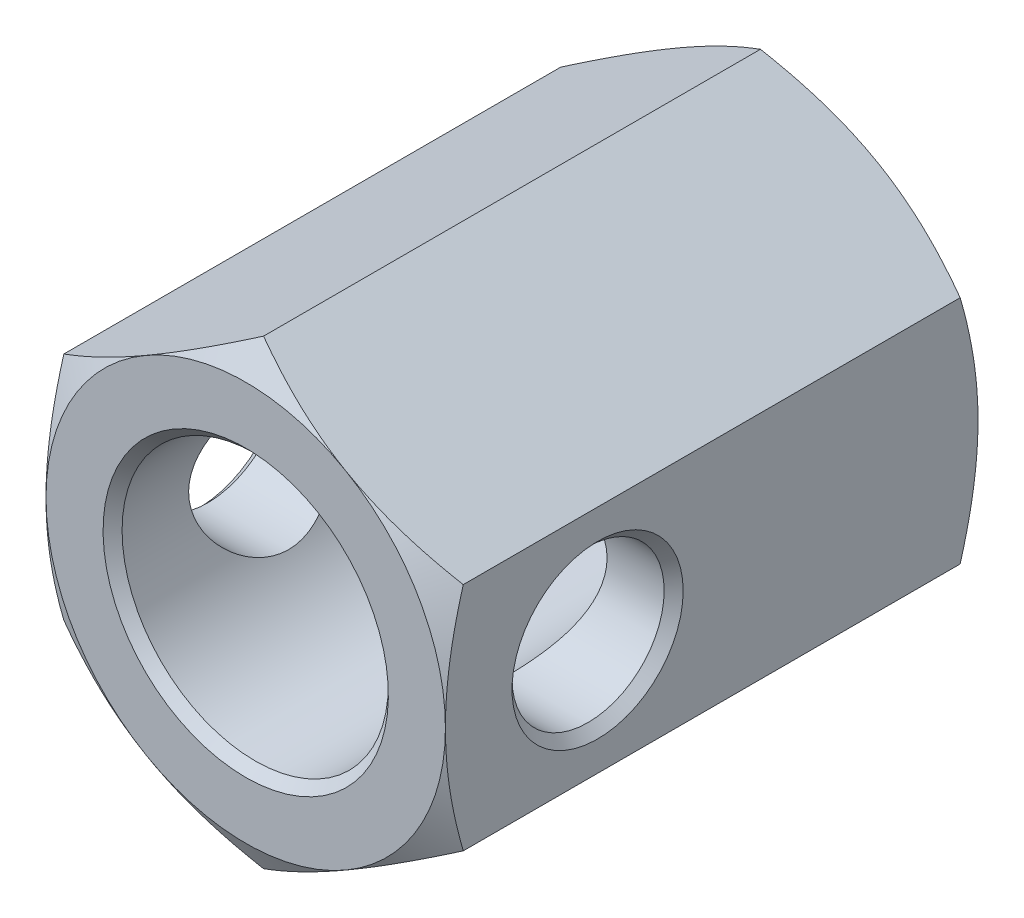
ISO-10303-21;
HEADER;
FILE_DESCRIPTION(('STEP AP214'),'2;1');
FILE_NAME('part.step','',(''),(''),'','','');
FILE_SCHEMA(('AUTOMOTIVE_DESIGN { 1 0 10303 214 1 1 1 1 }'));
ENDSEC;
DATA;
#1=APPLICATION_CONTEXT('core data for automotive mechanical design processes');
#2=APPLICATION_PROTOCOL_DEFINITION('international standard','automotive_design',2000,#1);
#3=PRODUCT_CONTEXT('',#1,'mechanical');
#4=PRODUCT('Part','Part','',(#3));
#5=PRODUCT_RELATED_PRODUCT_CATEGORY('part','',(#4));
#6=PRODUCT_DEFINITION_FORMATION('','',#4);
#7=PRODUCT_DEFINITION_CONTEXT('part definition',#1,'design');
#8=PRODUCT_DEFINITION('design','',#6,#7);
#9=PRODUCT_DEFINITION_SHAPE('','',#8);
#10=(LENGTH_UNIT() NAMED_UNIT(*) SI_UNIT(.MILLI.,.METRE.));
#11=(NAMED_UNIT(*) PLANE_ANGLE_UNIT() SI_UNIT($,.RADIAN.));
#12=(NAMED_UNIT(*) SI_UNIT($,.STERADIAN.) SOLID_ANGLE_UNIT());
#13=UNCERTAINTY_MEASURE_WITH_UNIT(LENGTH_MEASURE(1.E-05),#10,'distance_accuracy_value','');
#14=(GEOMETRIC_REPRESENTATION_CONTEXT(3) GLOBAL_UNCERTAINTY_ASSIGNED_CONTEXT((#13)) GLOBAL_UNIT_ASSIGNED_CONTEXT((#10,
#11,#12)) REPRESENTATION_CONTEXT('',''));
#15=CARTESIAN_POINT('',(0.,0.,0.));
#16=DIRECTION('',(0.,0.,1.));
#17=DIRECTION('',(1.,0.,0.));
#18=AXIS2_PLACEMENT_3D('',#15,#16,#17);
#19=CARTESIAN_POINT('',(-10.5,6.06217782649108,28.));
#20=DIRECTION('',(1.,0.,0.));
#21=DIRECTION('',(0.,0.,1.));
#22=AXIS2_PLACEMENT_3D('',#19,#20,#21);
#23=PLANE('',#22);
#24=CARTESIAN_POINT('',(-10.5,0.,20.));
#25=DIRECTION('',(1.,0.,0.));
#26=DIRECTION('',(0.,0.,1.));
#27=AXIS2_PLACEMENT_3D('',#24,#25,#26);
#28=CIRCLE('',#27,4.5);
#29=CARTESIAN_POINT('',(-10.5,0.,24.5));
#30=VERTEX_POINT('',#29);
#31=EDGE_CURVE('E22',#30,#30,#28,.T.);
#32=ORIENTED_EDGE('',*,*,#31,.T.);
#33=EDGE_LOOP('',(#32));
#34=FACE_BOUND('',#33,.T.);
#35=CARTESIAN_POINT('',(-10.5,16.454933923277,5.20746946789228));
#36=CARTESIAN_POINT('',(-10.5,16.2249139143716,5.09552006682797));
#37=CARTESIAN_POINT('',(-10.5,15.9946285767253,4.98411608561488));
#38=CARTESIAN_POINT('',(-10.5,15.5334719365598,4.76252215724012));
#39=CARTESIAN_POINT('',(-10.5,15.3026006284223,4.6523322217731));
#40=CARTESIAN_POINT('',(-10.5,14.6089656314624,4.32374032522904));
#41=CARTESIAN_POINT('',(-10.5,14.1452463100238,4.10734820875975));
#42=CARTESIAN_POINT('',(-10.5,13.2123185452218,3.68007114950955));
#43=CARTESIAN_POINT('',(-10.5,12.7430940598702,3.46922115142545));
#44=CARTESIAN_POINT('',(-10.5,11.8009731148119,3.05592036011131));
#45=CARTESIAN_POINT('',(-10.5,11.3280768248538,2.85346918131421));
#46=CARTESIAN_POINT('',(-10.5,10.3619273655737,2.4525715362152));
#47=CARTESIAN_POINT('',(-10.5,9.86852327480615,2.2544869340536));
#48=CARTESIAN_POINT('',(-10.5,8.87600265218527,1.87289836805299));
#49=CARTESIAN_POINT('',(-10.5,8.37688549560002,1.68939601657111));
#50=CARTESIAN_POINT('',(-10.5,7.3730408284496,1.34166736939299));
#51=CARTESIAN_POINT('',(-10.5,6.86832644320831,1.17740347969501));
#52=CARTESIAN_POINT('',(-10.5,5.85161221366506,0.87329923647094));
#53=CARTESIAN_POINT('',(-10.5,5.33961466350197,0.733451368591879));
#54=CARTESIAN_POINT('',(-10.5,4.56748436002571,0.547353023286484));
#55=CARTESIAN_POINT('',(-10.5,4.31015678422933,0.489397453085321));
#56=CARTESIAN_POINT('',(-10.5,3.79371230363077,0.382049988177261));
#57=CARTESIAN_POINT('',(-10.5,3.53459543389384,0.332657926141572));
#58=CARTESIAN_POINT('',(-10.5,3.01473864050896,0.243298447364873));
#59=CARTESIAN_POINT('',(-10.5,2.75399874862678,0.203330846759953));
#60=CARTESIAN_POINT('',(-10.5,2.23115789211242,0.133610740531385));
#61=CARTESIAN_POINT('',(-10.5,1.96905698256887,0.103857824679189));
#62=CARTESIAN_POINT('',(-10.5,1.44735659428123,0.0555409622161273));
#63=CARTESIAN_POINT('',(-10.5,1.18777057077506,0.0368326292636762));
#64=CARTESIAN_POINT('',(-10.5,0.668039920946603,0.0104184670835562));
#65=CARTESIAN_POINT('',(-10.5,0.407895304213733,0.00271245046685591));
#66=CARTESIAN_POINT('',(-10.5,-0.112486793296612,-0.00151291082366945));
#67=CARTESIAN_POINT('',(-10.5,-0.372724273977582,0.00196773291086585));
#68=CARTESIAN_POINT('',(-10.5,-0.892816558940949,0.02002851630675));
#69=CARTESIAN_POINT('',(-10.5,-1.15267134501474,0.0346091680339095));
#70=CARTESIAN_POINT('',(-10.5,-1.77207604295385,0.0822810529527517));
#71=CARTESIAN_POINT('',(-10.5,-2.13125105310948,0.120354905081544));
#72=CARTESIAN_POINT('',(-10.5,-2.84702964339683,0.215670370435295));
#73=CARTESIAN_POINT('',(-10.5,-3.20363288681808,0.272914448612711));
#74=CARTESIAN_POINT('',(-10.5,-4.26912557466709,0.470374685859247));
#75=CARTESIAN_POINT('',(-10.5,-4.97332146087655,0.636285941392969));
#76=CARTESIAN_POINT('',(-10.5,-6.02649020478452,0.925194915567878));
#77=CARTESIAN_POINT('',(-10.5,-6.38089374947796,1.02954553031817));
#78=CARTESIAN_POINT('',(-10.5,-7.0862619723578,1.24938875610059));
#79=CARTESIAN_POINT('',(-10.5,-7.43722662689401,1.36488144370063));
#80=CARTESIAN_POINT('',(-10.5,-8.13582129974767,1.60513074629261));
#81=CARTESIAN_POINT('',(-10.5,-8.48345230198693,1.72988452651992));
#82=CARTESIAN_POINT('',(-10.5,-9.17581412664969,1.98715802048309));
#83=CARTESIAN_POINT('',(-10.5,-9.5205449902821,2.11967762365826));
#84=CARTESIAN_POINT('',(-10.5,-10.3607883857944,2.45182231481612));
#85=CARTESIAN_POINT('',(-10.5,-10.8548981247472,2.65499043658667));
#86=CARTESIAN_POINT('',(-10.5,-11.8386640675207,3.07187016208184));
#87=CARTESIAN_POINT('',(-10.5,-12.3283199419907,3.28558253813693));
#88=CARTESIAN_POINT('',(-10.5,-13.3040511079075,3.72134897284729));
#89=CARTESIAN_POINT('',(-10.5,-13.7901254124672,3.94340523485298));
#90=CARTESIAN_POINT('',(-10.5,-14.7591888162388,4.39410073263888));
#91=CARTESIAN_POINT('',(-10.5,-15.2421779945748,4.6227397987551));
#92=CARTESIAN_POINT('',(-10.5,-16.2062035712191,5.08560710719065));
#93=CARTESIAN_POINT('',(-10.5,-16.6872368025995,5.31984193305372));
#94=CARTESIAN_POINT('',(-10.5,-17.6471720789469,5.79263835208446));
#95=CARTESIAN_POINT('',(-10.5,-18.1260741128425,6.03119996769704));
#96=CARTESIAN_POINT('',(-10.5,-19.0820141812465,6.51184415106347));
#97=CARTESIAN_POINT('',(-10.5,-19.559052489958,6.75392617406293));
#98=CARTESIAN_POINT('',(-10.5,-20.5116163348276,7.24105009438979));
#99=CARTESIAN_POINT('',(-10.5,-20.9871418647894,7.48609200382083));
#100=CARTESIAN_POINT('',(-10.5,-22.3269331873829,8.18091344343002));
#101=CARTESIAN_POINT('',(-10.5,-23.1897143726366,8.63355546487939));
#102=CARTESIAN_POINT('',(-10.5,-24.9120987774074,9.54491838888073));
#103=CARTESIAN_POINT('',(-10.5,-25.7717018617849,10.0036395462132));
#104=CARTESIAN_POINT('',(-10.5,-27.4860466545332,10.9244266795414));
#105=CARTESIAN_POINT('',(-10.5,-28.3407952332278,11.3864798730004));
#106=CARTESIAN_POINT('',(-10.5,-29.6214322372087,12.0822289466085));
#107=CARTESIAN_POINT('',(-10.5,-30.0480506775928,12.3145830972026));
#108=CARTESIAN_POINT('',(-10.5,-30.9008502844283,12.7800910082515));
#109=CARTESIAN_POINT('',(-10.5,-31.3270314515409,13.0132447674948));
#110=CARTESIAN_POINT('',(-10.5,-31.7530192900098,13.2467513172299));
#111=B_SPLINE_CURVE_WITH_KNOTS('',3,(#35,#36,#37,#38,#39,#40,#41,#42,#43,#44,#45,#46,#47,#48,
#49,#50,#51,#52,#53,#54,#55,#56,#57,#58,#59,#60,#61,#62,#63,#64,#65,#66,#67,#68,#69,#70,#71,#72,
#73,#74,#75,#76,#77,#78,#79,#80,#81,#82,#83,#84,#85,#86,#87,#88,#89,#90,#91,#92,#93,#94,#95,#96,
#97,#98,#99,#100,#101,#102,#103,#104,#105,#106,#107,#108,#109,#110),.UNSPECIFIED.,.F.,.F.,(4,2,
2,2,2,2,2,2,2,2,2,2,2,2,2,2,2,2,2,2,2,2,2,2,2,2,2,2,2,2,2,2,2,2,2,2,2,4),(0.,0.767446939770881,
1.53490126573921,3.07002835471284,4.61322822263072,6.15635716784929,7.75122531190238,
9.34626955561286,10.9381429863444,12.5295256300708,13.3207259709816,14.1119108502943,
14.9030802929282,15.6942179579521,16.4747698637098,17.2553084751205,18.0358462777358,
18.8164200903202,19.8993736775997,20.9824665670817,23.1497810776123,24.2580244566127,
25.366275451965,26.4741886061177,27.5820859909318,29.1846629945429,30.7873575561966,
32.3904783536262,33.9935578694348,35.5986266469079,37.203703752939,38.8085350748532,
40.4133729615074,43.3362600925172,46.2592701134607,49.1741845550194,50.6315533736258,
52.088919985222),.UNSPECIFIED.);
#112=CARTESIAN_POINT('',(-10.5,-6.06217782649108,0.937822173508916));
#113=VERTEX_POINT('',#112);
#114=CARTESIAN_POINT('',(-10.5,0.,0.));
#115=VERTEX_POINT('',#114);
#116=EDGE_CURVE('E299',#113,#115,#111,.F.);
#117=ORIENTED_EDGE('',*,*,#116,.F.);
#118=DIRECTION('',(0.,0.,-1.));
#119=VECTOR('',#118,1.);
#120=CARTESIAN_POINT('',(-10.5,-6.06217782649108,28.));
#121=LINE('',#120,#119);
#122=CARTESIAN_POINT('',(-10.5,-6.06217782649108,27.0621778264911));
#123=VERTEX_POINT('',#122);
#124=EDGE_CURVE('E302',#123,#113,#121,.T.);
#125=ORIENTED_EDGE('',*,*,#124,.F.);
#126=CARTESIAN_POINT('',(-10.5,16.454933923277,22.7925305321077));
#127=CARTESIAN_POINT('',(-10.5,16.2249139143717,22.9044799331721));
#128=CARTESIAN_POINT('',(-10.5,15.9946285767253,23.0158839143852));
#129=CARTESIAN_POINT('',(-10.5,15.5334719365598,23.2374778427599));
#130=CARTESIAN_POINT('',(-10.5,15.3026006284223,23.347667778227));
#131=CARTESIAN_POINT('',(-10.5,14.6089656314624,23.676259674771));
#132=CARTESIAN_POINT('',(-10.5,14.1452463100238,23.8926517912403));
#133=CARTESIAN_POINT('',(-10.5,13.2123185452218,24.3199288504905));
#134=CARTESIAN_POINT('',(-10.5,12.7430940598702,24.5307788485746));
#135=CARTESIAN_POINT('',(-10.5,11.800973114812,24.9440796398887));
#136=CARTESIAN_POINT('',(-10.5,11.3280768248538,25.1465308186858));
#137=CARTESIAN_POINT('',(-10.5,10.3619273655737,25.5474284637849));
#138=CARTESIAN_POINT('',(-10.5,9.86852327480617,25.7455130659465));
#139=CARTESIAN_POINT('',(-10.5,8.87600265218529,26.1271016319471));
#140=CARTESIAN_POINT('',(-10.5,8.37688549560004,26.3106039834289));
#141=CARTESIAN_POINT('',(-10.5,7.37304082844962,26.6583326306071));
#142=CARTESIAN_POINT('',(-10.5,6.86832644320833,26.8225965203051));
#143=CARTESIAN_POINT('',(-10.5,5.85161221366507,27.1267007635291));
#144=CARTESIAN_POINT('',(-10.5,5.33961466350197,27.2665486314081));
#145=CARTESIAN_POINT('',(-10.5,4.56748436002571,27.4526469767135));
#146=CARTESIAN_POINT('',(-10.5,4.31015678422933,27.5106025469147));
#147=CARTESIAN_POINT('',(-10.5,3.79371230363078,27.6179500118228));
#148=CARTESIAN_POINT('',(-10.5,3.53459543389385,27.6673420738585));
#149=CARTESIAN_POINT('',(-10.5,3.01473864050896,27.7567015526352));
#150=CARTESIAN_POINT('',(-10.5,2.75399874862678,27.7966691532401));
#151=CARTESIAN_POINT('',(-10.5,2.23115789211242,27.8663892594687));
#152=CARTESIAN_POINT('',(-10.5,1.96905698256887,27.8961421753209));
#153=CARTESIAN_POINT('',(-10.5,1.44735659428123,27.9444590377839));
#154=CARTESIAN_POINT('',(-10.5,1.18777057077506,27.9631673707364));
#155=CARTESIAN_POINT('',(-10.5,0.668039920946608,27.9895815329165));
#156=CARTESIAN_POINT('',(-10.5,0.407895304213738,27.9972875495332));
#157=CARTESIAN_POINT('',(-10.5,-0.112486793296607,28.0015129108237));
#158=CARTESIAN_POINT('',(-10.5,-0.372724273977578,27.9980322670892));
#159=CARTESIAN_POINT('',(-10.5,-0.892816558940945,27.9799714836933));
#160=CARTESIAN_POINT('',(-10.5,-1.15267134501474,27.9653908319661));
#161=CARTESIAN_POINT('',(-10.5,-1.77207604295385,27.9177189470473));
#162=CARTESIAN_POINT('',(-10.5,-2.13125105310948,27.8796450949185));
#163=CARTESIAN_POINT('',(-10.5,-2.84702964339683,27.7843296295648));
#164=CARTESIAN_POINT('',(-10.5,-3.20363288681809,27.7270855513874));
#165=CARTESIAN_POINT('',(-10.5,-4.2691255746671,27.5296253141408));
#166=CARTESIAN_POINT('',(-10.5,-4.97332146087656,27.3637140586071));
#167=CARTESIAN_POINT('',(-10.5,-6.02649020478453,27.0748050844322));
#168=CARTESIAN_POINT('',(-10.5,-6.38089374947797,26.9704544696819));
#169=CARTESIAN_POINT('',(-10.5,-7.08626197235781,26.7506112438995));
#170=CARTESIAN_POINT('',(-10.5,-7.43722662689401,26.6351185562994));
#171=CARTESIAN_POINT('',(-10.5,-8.13582129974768,26.3948692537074));
#172=CARTESIAN_POINT('',(-10.5,-8.48345230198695,26.2701154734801));
#173=CARTESIAN_POINT('',(-10.5,-9.1758141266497,26.012841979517));
#174=CARTESIAN_POINT('',(-10.5,-9.5205449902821,25.8803223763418));
#175=CARTESIAN_POINT('',(-10.5,-10.3607883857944,25.5481776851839));
#176=CARTESIAN_POINT('',(-10.5,-10.8548981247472,25.3450095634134));
#177=CARTESIAN_POINT('',(-10.5,-11.8386640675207,24.9281298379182));
#178=CARTESIAN_POINT('',(-10.5,-12.3283199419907,24.7144174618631));
#179=CARTESIAN_POINT('',(-10.5,-13.3040511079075,24.2786510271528));
#180=CARTESIAN_POINT('',(-10.5,-13.7901254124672,24.0565947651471));
#181=CARTESIAN_POINT('',(-10.5,-14.7591888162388,23.6058992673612));
#182=CARTESIAN_POINT('',(-10.5,-15.2421779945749,23.3772602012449));
#183=CARTESIAN_POINT('',(-10.5,-16.2062035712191,22.9143928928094));
#184=CARTESIAN_POINT('',(-10.5,-16.6872368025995,22.6801580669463));
#185=CARTESIAN_POINT('',(-10.5,-17.6471720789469,22.2073616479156));
#186=CARTESIAN_POINT('',(-10.5,-18.1260741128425,21.968800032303));
#187=CARTESIAN_POINT('',(-10.5,-19.0820141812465,21.4881558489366));
#188=CARTESIAN_POINT('',(-10.5,-19.5590524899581,21.2460738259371));
#189=CARTESIAN_POINT('',(-10.5,-20.5116163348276,20.7589499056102));
#190=CARTESIAN_POINT('',(-10.5,-20.9871418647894,20.5139079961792));
#191=CARTESIAN_POINT('',(-10.5,-22.3269331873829,19.81908655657));
#192=CARTESIAN_POINT('',(-10.5,-23.1897143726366,19.3664445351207));
#193=CARTESIAN_POINT('',(-10.5,-24.9120987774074,18.4550816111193));
#194=CARTESIAN_POINT('',(-10.5,-25.7717018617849,17.9963604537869));
#195=CARTESIAN_POINT('',(-10.5,-27.4860466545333,17.0755733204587));
#196=CARTESIAN_POINT('',(-10.5,-28.3407952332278,16.6135201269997));
#197=CARTESIAN_POINT('',(-10.5,-29.6214322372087,15.9177710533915));
#198=CARTESIAN_POINT('',(-10.5,-30.0480506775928,15.6854169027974));
#199=CARTESIAN_POINT('',(-10.5,-30.9008502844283,15.2199089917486));
#200=CARTESIAN_POINT('',(-10.5,-31.3270314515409,14.9867552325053));
#201=CARTESIAN_POINT('',(-10.5,-31.7530192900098,14.75324868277));
#202=B_SPLINE_CURVE_WITH_KNOTS('',3,(#126,#127,#128,#129,#130,#131,#132,#133,#134,#135,#136,
#137,#138,#139,#140,#141,#142,#143,#144,#145,#146,#147,#148,#149,#150,#151,#152,#153,#154,#155,
#156,#157,#158,#159,#160,#161,#162,#163,#164,#165,#166,#167,#168,#169,#170,#171,#172,#173,#174,
#175,#176,#177,#178,#179,#180,#181,#182,#183,#184,#185,#186,#187,#188,#189,#190,#191,#192,#193,
#194,#195,#196,#197,#198,#199,#200,#201),.UNSPECIFIED.,.F.,.F.,(4,2,2,2,2,2,2,2,2,2,2,2,2,2,2,2,
2,2,2,2,2,2,2,2,2,2,2,2,2,2,2,2,2,2,2,2,2,4),(0.,0.767446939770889,1.53490126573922,
3.07002835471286,4.61322822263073,6.1563571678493,7.75122531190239,9.34626955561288,
10.9381429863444,12.5295256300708,13.3207259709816,14.1119108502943,14.9030802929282,
15.6942179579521,16.4747698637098,17.2553084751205,18.0358462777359,18.8164200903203,
19.8993736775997,20.9824665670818,23.1497810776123,24.2580244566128,25.366275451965,
26.4741886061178,27.5820859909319,29.184662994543,30.7873575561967,32.3904783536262,
33.9935578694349,35.598626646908,37.2037037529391,38.8085350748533,40.4133729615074,
43.3362600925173,46.2592701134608,49.1741845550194,50.6315533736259,52.0889199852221),.UNSPECIFIED.);
#203=CARTESIAN_POINT('',(-10.5,0.,28.));
#204=VERTEX_POINT('',#203);
#205=EDGE_CURVE('E238',#204,#123,#202,.T.);
#206=ORIENTED_EDGE('',*,*,#205,.F.);
#207=CARTESIAN_POINT('',(-10.5,6.06217782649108,27.0621778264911));
#208=VERTEX_POINT('',#207);
#209=EDGE_CURVE('E368',#208,#204,#202,.T.);
#210=ORIENTED_EDGE('',*,*,#209,.F.);
#211=DIRECTION('',(0.,0.,-1.));
#212=VECTOR('',#211,1.);
#213=CARTESIAN_POINT('',(-10.5,6.06217782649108,28.));
#214=LINE('',#213,#212);
#215=CARTESIAN_POINT('',(-10.5,6.06217782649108,0.937822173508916));
#216=VERTEX_POINT('',#215);
#217=EDGE_CURVE('E362',#208,#216,#214,.T.);
#218=ORIENTED_EDGE('',*,*,#217,.T.);
#219=EDGE_CURVE('E192',#115,#216,#111,.F.);
#220=ORIENTED_EDGE('',*,*,#219,.F.);
#221=EDGE_LOOP('',(#117,#125,#206,#210,#218,#220));
#222=FACE_BOUND('',#221,.T.);
#223=ADVANCED_FACE('F14',(#34,#222),#23,.F.);
#224=CARTESIAN_POINT('',(-10.5,-6.06217782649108,28.));
#225=DIRECTION('',(0.5,0.866025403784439,0.));
#226=DIRECTION('',(-0.866025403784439,0.5,0.));
#227=AXIS2_PLACEMENT_3D('',#224,#225,#226);
#228=PLANE('',#227);
#229=CARTESIAN_POINT('',(0.000199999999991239,-12.124471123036,0.937888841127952));
#230=CARTESIAN_POINT('',(-0.230612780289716,-11.9912113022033,0.860963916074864));
#231=CARTESIAN_POINT('',(-0.462286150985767,-11.8574546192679,0.787530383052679));
#232=CARTESIAN_POINT('',(-0.927490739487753,-11.588868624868,0.648614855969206));
#233=CARTESIAN_POINT('',(-1.16102254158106,-11.4540389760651,0.583135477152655));
#234=CARTESIAN_POINT('',(-1.86538084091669,-11.0473775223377,0.399895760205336));
#235=CARTESIAN_POINT('',(-2.33898788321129,-10.7739403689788,0.29566995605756));
#236=CARTESIAN_POINT('',(-3.04771913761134,-10.3647541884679,0.173455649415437));
#237=CARTESIAN_POINT('',(-3.28072597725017,-10.2302276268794,0.138641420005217));
#238=CARTESIAN_POINT('',(-3.74781845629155,-9.96055165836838,0.0802602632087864));
#239=CARTESIAN_POINT('',(-3.9819041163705,-9.82540223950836,0.0566935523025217));
#240=CARTESIAN_POINT('',(-4.45046590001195,-9.554877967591,0.0214112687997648));
#241=CARTESIAN_POINT('',(-4.68494122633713,-9.41950357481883,0.0096816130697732));
#242=CARTESIAN_POINT('',(-5.15410845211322,-9.14862975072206,-0.00167731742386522));
#243=CARTESIAN_POINT('',(-5.38880034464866,-9.01313032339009,-0.00130696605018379));
#244=CARTESIAN_POINT('',(-5.82756124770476,-8.75981159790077,0.0106922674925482));
#245=CARTESIAN_POINT('',(-6.03166122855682,-8.64197441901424,0.0208573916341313));
#246=CARTESIAN_POINT('',(-6.43938384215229,-8.4065756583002,0.0501416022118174));
#247=CARTESIAN_POINT('',(-6.64300644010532,-8.28901409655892,0.0692613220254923));
#248=CARTESIAN_POINT('',(-7.25308524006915,-7.93678493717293,0.139600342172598));
#249=CARTESIAN_POINT('',(-7.65846156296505,-7.70274080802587,0.203790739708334));
#250=CARTESIAN_POINT('',(-8.47351422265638,-7.23216993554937,0.364267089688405));
#251=CARTESIAN_POINT('',(-8.88308654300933,-6.99570324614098,0.461233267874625));
#252=CARTESIAN_POINT('',(-9.69612354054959,-6.52629611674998,0.681306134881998));
#253=CARTESIAN_POINT('',(-10.0995986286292,-6.29334966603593,0.804361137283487));
#254=CARTESIAN_POINT('',(-10.5002,-6.06206235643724,0.937888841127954));
#255=B_SPLINE_CURVE_WITH_KNOTS('',3,(#229,#230,#231,#232,#233,#234,#235,#236,#237,#238,#239,
#240,#241,#242,#243,#244,#245,#246,#247,#248,#249,#250,#251,#252,#253,#254),.UNSPECIFIED.,.F.,
.F.,(4,2,2,2,2,2,2,2,2,2,2,2,4),(0.,0.83213025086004,1.66453336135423,3.33288308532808,
4.14658222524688,4.9602970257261,5.77304256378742,6.58576298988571,7.29326708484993,
8.00082123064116,9.4169349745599,10.864454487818,12.3091325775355),.UNSPECIFIED.);
#256=CARTESIAN_POINT('',(0.,-12.1243556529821,0.937822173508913));
#257=VERTEX_POINT('',#256);
#258=CARTESIAN_POINT('',(-5.25,-9.09326673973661,0.));
#259=VERTEX_POINT('',#258);
#260=EDGE_CURVE('E124',#257,#259,#255,.T.);
#261=ORIENTED_EDGE('',*,*,#260,.F.);
#262=DIRECTION('',(0.,0.,-1.));
#263=VECTOR('',#262,1.);
#264=CARTESIAN_POINT('',(0.,-12.1243556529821,28.));
#265=LINE('',#264,#263);
#266=CARTESIAN_POINT('',(0.,-12.1243556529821,27.0621778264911));
#267=VERTEX_POINT('',#266);
#268=EDGE_CURVE('E140',#267,#257,#265,.T.);
#269=ORIENTED_EDGE('',*,*,#268,.F.);
#270=CARTESIAN_POINT('',(-10.5002,-6.06206235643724,27.062111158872));
#271=CARTESIAN_POINT('',(-10.2693872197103,-6.19532217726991,27.1390360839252));
#272=CARTESIAN_POINT('',(-10.0377138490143,-6.32907886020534,27.2124696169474));
#273=CARTESIAN_POINT('',(-9.57250926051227,-6.59766485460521,27.3513851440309));
#274=CARTESIAN_POINT('',(-9.33897745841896,-6.73249450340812,27.4168645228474));
#275=CARTESIAN_POINT('',(-8.63461915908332,-7.13915595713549,27.6001042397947));
#276=CARTESIAN_POINT('',(-8.16101211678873,-7.41259311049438,27.7043300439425));
#277=CARTESIAN_POINT('',(-7.45228086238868,-7.82177929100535,27.8265443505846));
#278=CARTESIAN_POINT('',(-7.21927402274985,-7.95630585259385,27.8613585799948));
#279=CARTESIAN_POINT('',(-6.75218154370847,-8.22598182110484,27.9197397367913));
#280=CARTESIAN_POINT('',(-6.51809588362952,-8.36113123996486,27.9433064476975));
#281=CARTESIAN_POINT('',(-6.04953409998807,-8.63165551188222,27.9785887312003));
#282=CARTESIAN_POINT('',(-5.81505877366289,-8.76702990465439,27.9903183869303));
#283=CARTESIAN_POINT('',(-5.3458915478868,-9.03790372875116,28.0016773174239));
#284=CARTESIAN_POINT('',(-5.11119965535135,-9.17340315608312,28.0013069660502));
#285=CARTESIAN_POINT('',(-4.67243875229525,-9.42672188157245,27.9893077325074));
#286=CARTESIAN_POINT('',(-4.46833877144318,-9.54455906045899,27.9791426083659));
#287=CARTESIAN_POINT('',(-4.06061615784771,-9.77995782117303,27.9498583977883));
#288=CARTESIAN_POINT('',(-3.85699355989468,-9.89751938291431,27.9307386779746));
#289=CARTESIAN_POINT('',(-3.24691475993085,-10.2497485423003,27.8603996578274));
#290=CARTESIAN_POINT('',(-2.84153843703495,-10.4837926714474,27.7962092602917));
#291=CARTESIAN_POINT('',(-2.02648577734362,-10.9543635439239,27.6357329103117));
#292=CARTESIAN_POINT('',(-1.61691345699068,-11.1908302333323,27.5387667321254));
#293=CARTESIAN_POINT('',(-0.803876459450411,-11.6602373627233,27.3186938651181));
#294=CARTESIAN_POINT('',(-0.400401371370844,-11.8931838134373,27.1956388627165));
#295=CARTESIAN_POINT('',(0.000199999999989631,-12.124471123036,27.062111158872));
#296=B_SPLINE_CURVE_WITH_KNOTS('',3,(#270,#271,#272,#273,#274,#275,#276,#277,#278,#279,#280,
#281,#282,#283,#284,#285,#286,#287,#288,#289,#290,#291,#292,#293,#294,#295),.UNSPECIFIED.,.F.,
.F.,(4,2,2,2,2,2,2,2,2,2,2,2,4),(0.,0.832130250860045,1.66453336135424,3.33288308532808,
4.14658222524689,4.9602970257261,5.77304256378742,6.58576298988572,7.29326708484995,
8.00082123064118,9.41693497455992,10.864454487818,12.3091325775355),.UNSPECIFIED.);
#297=CARTESIAN_POINT('',(-5.25,-9.09326673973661,28.));
#298=VERTEX_POINT('',#297);
#299=EDGE_CURVE('E231',#298,#267,#296,.T.);
#300=ORIENTED_EDGE('',*,*,#299,.F.);
#301=EDGE_CURVE('E237',#123,#298,#296,.T.);
#302=ORIENTED_EDGE('',*,*,#301,.F.);
#303=ORIENTED_EDGE('',*,*,#124,.T.);
#304=EDGE_CURVE('E150',#259,#113,#255,.T.);
#305=ORIENTED_EDGE('',*,*,#304,.F.);
#306=EDGE_LOOP('',(#261,#269,#300,#302,#303,#305));
#307=FACE_BOUND('',#306,.T.);
#308=ADVANCED_FACE('F244',(#307),#228,.F.);
#309=CARTESIAN_POINT('',(0.,-12.1243556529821,28.));
#310=DIRECTION('',(-0.5,0.866025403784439,0.));
#311=DIRECTION('',(-0.866025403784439,-0.5,0.));
#312=AXIS2_PLACEMENT_3D('',#309,#310,#311);
#313=PLANE('',#312);
#314=CARTESIAN_POINT('',(10.5002,-6.06206235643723,0.93788884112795));
#315=CARTESIAN_POINT('',(10.2693872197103,-6.1953221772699,0.860963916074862));
#316=CARTESIAN_POINT('',(10.0377138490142,-6.32907886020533,0.787530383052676));
#317=CARTESIAN_POINT('',(9.57250926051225,-6.5976648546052,0.648614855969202));
#318=CARTESIAN_POINT('',(9.33897745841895,-6.73249450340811,0.58313547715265));
#319=CARTESIAN_POINT('',(8.63461915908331,-7.13915595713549,0.399895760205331));
#320=CARTESIAN_POINT('',(8.16101211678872,-7.41259311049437,0.295669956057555));
#321=CARTESIAN_POINT('',(7.45228086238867,-7.82177929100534,0.173455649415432));
#322=CARTESIAN_POINT('',(7.21927402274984,-7.95630585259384,0.138641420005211));
#323=CARTESIAN_POINT('',(6.75218154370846,-8.22598182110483,0.080260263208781));
#324=CARTESIAN_POINT('',(6.51809588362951,-8.36113123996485,0.0566935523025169));
#325=CARTESIAN_POINT('',(6.04953409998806,-8.63165551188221,0.0214112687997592));
#326=CARTESIAN_POINT('',(5.81505877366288,-8.76702990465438,0.00968161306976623));
#327=CARTESIAN_POINT('',(5.34589154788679,-9.03790372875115,-0.00167731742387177));
#328=CARTESIAN_POINT('',(5.11119965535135,-9.17340315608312,-0.00130696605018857));
#329=CARTESIAN_POINT('',(4.67243875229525,-9.42672188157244,0.010692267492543));
#330=CARTESIAN_POINT('',(4.46833877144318,-9.54455906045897,0.0208573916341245));
#331=CARTESIAN_POINT('',(4.06061615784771,-9.77995782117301,0.0501416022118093));
#332=CARTESIAN_POINT('',(3.85699355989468,-9.89751938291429,0.0692613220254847));
#333=CARTESIAN_POINT('',(3.24691475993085,-10.2497485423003,0.139600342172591));
#334=CARTESIAN_POINT('',(2.84153843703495,-10.4837926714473,0.203790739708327));
#335=CARTESIAN_POINT('',(2.02648577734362,-10.9543635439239,0.364267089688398));
#336=CARTESIAN_POINT('',(1.61691345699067,-11.1908302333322,0.461233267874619));
#337=CARTESIAN_POINT('',(0.8038764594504,-11.6602373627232,0.681306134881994));
#338=CARTESIAN_POINT('',(0.40040137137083,-11.8931838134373,0.804361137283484));
#339=CARTESIAN_POINT('',(-0.00020000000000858,-12.124471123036,0.937888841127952));
#340=B_SPLINE_CURVE_WITH_KNOTS('',3,(#314,#315,#316,#317,#318,#319,#320,#321,#322,#323,#324,
#325,#326,#327,#328,#329,#330,#331,#332,#333,#334,#335,#336,#337,#338,#339),.UNSPECIFIED.,.F.,
.F.,(4,2,2,2,2,2,2,2,2,2,2,2,4),(0.,0.832130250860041,1.66453336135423,3.33288308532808,
4.14658222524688,4.9602970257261,5.77304256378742,6.58576298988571,7.29326708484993,
8.00082123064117,9.41693497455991,10.864454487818,12.3091325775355),.UNSPECIFIED.);
#341=CARTESIAN_POINT('',(10.5,-6.06217782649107,0.937822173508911));
#342=VERTEX_POINT('',#341);
#343=CARTESIAN_POINT('',(5.25,-9.09326673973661,0.));
#344=VERTEX_POINT('',#343);
#345=EDGE_CURVE('E103',#342,#344,#340,.T.);
#346=ORIENTED_EDGE('',*,*,#345,.F.);
#347=DIRECTION('',(0.,0.,-1.));
#348=VECTOR('',#347,1.);
#349=CARTESIAN_POINT('',(10.5,-6.06217782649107,28.));
#350=LINE('',#349,#348);
#351=CARTESIAN_POINT('',(10.5,-6.06217782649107,27.0621778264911));
#352=VERTEX_POINT('',#351);
#353=EDGE_CURVE('E312',#352,#342,#350,.T.);
#354=ORIENTED_EDGE('',*,*,#353,.F.);
#355=CARTESIAN_POINT('',(-0.000200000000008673,-12.124471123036,27.062111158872));
#356=CARTESIAN_POINT('',(0.230612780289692,-11.9912113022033,27.1390360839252));
#357=CARTESIAN_POINT('',(0.46228615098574,-11.8574546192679,27.2124696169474));
#358=CARTESIAN_POINT('',(0.927490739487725,-11.588868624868,27.3513851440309));
#359=CARTESIAN_POINT('',(1.16102254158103,-11.4540389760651,27.4168645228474));
#360=CARTESIAN_POINT('',(1.86538084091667,-11.0473775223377,27.6001042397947));
#361=CARTESIAN_POINT('',(2.33898788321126,-10.7739403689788,27.7043300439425));
#362=CARTESIAN_POINT('',(3.04771913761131,-10.3647541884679,27.8265443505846));
#363=CARTESIAN_POINT('',(3.28072597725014,-10.2302276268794,27.8613585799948));
#364=CARTESIAN_POINT('',(3.74781845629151,-9.96055165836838,27.9197397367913));
#365=CARTESIAN_POINT('',(3.98190411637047,-9.82540223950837,27.9433064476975));
#366=CARTESIAN_POINT('',(4.45046590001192,-9.55487796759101,27.9785887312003));
#367=CARTESIAN_POINT('',(4.6849412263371,-9.41950357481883,27.9903183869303));
#368=CARTESIAN_POINT('',(5.15410845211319,-9.14862975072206,28.0016773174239));
#369=CARTESIAN_POINT('',(5.38880034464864,-9.01313032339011,28.0013069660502));
#370=CARTESIAN_POINT('',(5.82756124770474,-8.75981159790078,27.9893077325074));
#371=CARTESIAN_POINT('',(6.03166122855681,-8.64197441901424,27.9791426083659));
#372=CARTESIAN_POINT('',(6.43938384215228,-8.40657565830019,27.9498583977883));
#373=CARTESIAN_POINT('',(6.64300644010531,-8.28901409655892,27.9307386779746));
#374=CARTESIAN_POINT('',(7.25308524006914,-7.93678493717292,27.8603996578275));
#375=CARTESIAN_POINT('',(7.65846156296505,-7.70274080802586,27.7962092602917));
#376=CARTESIAN_POINT('',(8.47351422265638,-7.23216993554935,27.6357329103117));
#377=CARTESIAN_POINT('',(8.88308654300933,-6.99570324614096,27.5387667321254));
#378=CARTESIAN_POINT('',(9.6961235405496,-6.52629611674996,27.3186938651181));
#379=CARTESIAN_POINT('',(10.0995986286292,-6.29334966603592,27.1956388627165));
#380=CARTESIAN_POINT('',(10.5002,-6.06206235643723,27.062111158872));
#381=B_SPLINE_CURVE_WITH_KNOTS('',3,(#355,#356,#357,#358,#359,#360,#361,#362,#363,#364,#365,
#366,#367,#368,#369,#370,#371,#372,#373,#374,#375,#376,#377,#378,#379,#380),.UNSPECIFIED.,.F.,
.F.,(4,2,2,2,2,2,2,2,2,2,2,2,4),(0.,0.832130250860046,1.66453336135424,3.33288308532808,
4.14658222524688,4.9602970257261,5.77304256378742,6.58576298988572,7.29326708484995,
8.00082123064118,9.41693497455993,10.8644544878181,12.3091325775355),.UNSPECIFIED.);
#382=CARTESIAN_POINT('',(5.25,-9.0932667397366,28.));
#383=VERTEX_POINT('',#382);
#384=EDGE_CURVE('E224',#383,#352,#381,.T.);
#385=ORIENTED_EDGE('',*,*,#384,.F.);
#386=EDGE_CURVE('E230',#267,#383,#381,.T.);
#387=ORIENTED_EDGE('',*,*,#386,.F.);
#388=ORIENTED_EDGE('',*,*,#268,.T.);
#389=EDGE_CURVE('E116',#344,#257,#340,.T.);
#390=ORIENTED_EDGE('',*,*,#389,.F.);
#391=EDGE_LOOP('',(#346,#354,#385,#387,#388,#390));
#392=FACE_BOUND('',#391,.T.);
#393=ADVANCED_FACE('F137',(#392),#313,.F.);
#394=CARTESIAN_POINT('',(10.5,-6.06217782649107,28.));
#395=DIRECTION('',(-1.,0.,0.));
#396=DIRECTION('',(0.,0.,-1.));
#397=AXIS2_PLACEMENT_3D('',#394,#395,#396);
#398=PLANE('',#397);
#399=CARTESIAN_POINT('',(10.5,0.,20.));
#400=DIRECTION('',(-1.,0.,0.));
#401=DIRECTION('',(0.,0.,-1.));
#402=AXIS2_PLACEMENT_3D('',#399,#400,#401);
#403=CIRCLE('',#402,4.5);
#404=CARTESIAN_POINT('',(10.5,0.,15.5));
#405=VERTEX_POINT('',#404);
#406=EDGE_CURVE('E275',#405,#405,#403,.T.);
#407=ORIENTED_EDGE('',*,*,#406,.T.);
#408=EDGE_LOOP('',(#407));
#409=FACE_BOUND('',#408,.T.);
#410=CARTESIAN_POINT('',(10.5,16.454933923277,5.20746946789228));
#411=CARTESIAN_POINT('',(10.5,16.2249139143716,5.09552006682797));
#412=CARTESIAN_POINT('',(10.5,15.9946285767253,4.98411608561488));
#413=CARTESIAN_POINT('',(10.5,15.5334719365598,4.76252215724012));
#414=CARTESIAN_POINT('',(10.5,15.3026006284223,4.6523322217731));
#415=CARTESIAN_POINT('',(10.5,14.6089656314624,4.32374032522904));
#416=CARTESIAN_POINT('',(10.5,14.1452463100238,4.10734820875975));
#417=CARTESIAN_POINT('',(10.5,13.2123185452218,3.68007114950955));
#418=CARTESIAN_POINT('',(10.5,12.7430940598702,3.46922115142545));
#419=CARTESIAN_POINT('',(10.5,11.8009731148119,3.05592036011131));
#420=CARTESIAN_POINT('',(10.5,11.3280768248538,2.85346918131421));
#421=CARTESIAN_POINT('',(10.5,10.3619273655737,2.45257153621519));
#422=CARTESIAN_POINT('',(10.5,9.86852327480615,2.2544869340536));
#423=CARTESIAN_POINT('',(10.5,8.87600265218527,1.87289836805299));
#424=CARTESIAN_POINT('',(10.5,8.37688549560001,1.68939601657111));
#425=CARTESIAN_POINT('',(10.5,7.37304082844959,1.34166736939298));
#426=CARTESIAN_POINT('',(10.5,6.8683264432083,1.17740347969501));
#427=CARTESIAN_POINT('',(10.5,5.85161221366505,0.873299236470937));
#428=CARTESIAN_POINT('',(10.5,5.33961466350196,0.733451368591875));
#429=CARTESIAN_POINT('',(10.5,4.5674843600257,0.547353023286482));
#430=CARTESIAN_POINT('',(10.5,4.31015678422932,0.489397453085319));
#431=CARTESIAN_POINT('',(10.5,3.79371230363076,0.38204998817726));
#432=CARTESIAN_POINT('',(10.5,3.53459543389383,0.33265792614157));
#433=CARTESIAN_POINT('',(10.5,3.01473864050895,0.24329844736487));
#434=CARTESIAN_POINT('',(10.5,2.75399874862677,0.20333084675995));
#435=CARTESIAN_POINT('',(10.5,2.23115789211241,0.133610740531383));
#436=CARTESIAN_POINT('',(10.5,1.96905698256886,0.103857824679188));
#437=CARTESIAN_POINT('',(10.5,1.44735659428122,0.0555409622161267));
#438=CARTESIAN_POINT('',(10.5,1.18777057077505,0.036832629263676));
#439=CARTESIAN_POINT('',(10.5,0.668039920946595,0.0104184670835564));
#440=CARTESIAN_POINT('',(10.5,0.407895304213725,0.00271245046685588));
#441=CARTESIAN_POINT('',(10.5,-0.112486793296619,-0.00151291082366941));
#442=CARTESIAN_POINT('',(10.5,-0.372724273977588,0.00196773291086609));
#443=CARTESIAN_POINT('',(10.5,-0.892816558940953,0.0200285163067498));
#444=CARTESIAN_POINT('',(10.5,-1.15267134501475,0.0346091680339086));
#445=CARTESIAN_POINT('',(10.5,-1.77207604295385,0.0822810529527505));
#446=CARTESIAN_POINT('',(10.5,-2.13125105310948,0.120354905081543));
#447=CARTESIAN_POINT('',(10.5,-2.84702964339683,0.215670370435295));
#448=CARTESIAN_POINT('',(10.5,-3.20363288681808,0.272914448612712));
#449=CARTESIAN_POINT('',(10.5,-4.2691255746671,0.470374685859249));
#450=CARTESIAN_POINT('',(10.5,-4.97332146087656,0.63628594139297));
#451=CARTESIAN_POINT('',(10.5,-6.02649020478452,0.925194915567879));
#452=CARTESIAN_POINT('',(10.5,-6.38089374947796,1.02954553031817));
#453=CARTESIAN_POINT('',(10.5,-7.0862619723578,1.24938875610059));
#454=CARTESIAN_POINT('',(10.5,-7.43722662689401,1.36488144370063));
#455=CARTESIAN_POINT('',(10.5,-8.13582129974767,1.60513074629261));
#456=CARTESIAN_POINT('',(10.5,-8.48345230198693,1.72988452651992));
#457=CARTESIAN_POINT('',(10.5,-9.17581412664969,1.98715802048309));
#458=CARTESIAN_POINT('',(10.5,-9.5205449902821,2.11967762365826));
#459=CARTESIAN_POINT('',(10.5,-10.3607883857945,2.45182231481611));
#460=CARTESIAN_POINT('',(10.5,-10.8548981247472,2.65499043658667));
#461=CARTESIAN_POINT('',(10.5,-11.8386640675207,3.07187016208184));
#462=CARTESIAN_POINT('',(10.5,-12.3283199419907,3.28558253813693));
#463=CARTESIAN_POINT('',(10.5,-13.3040511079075,3.72134897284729));
#464=CARTESIAN_POINT('',(10.5,-13.7901254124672,3.94340523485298));
#465=CARTESIAN_POINT('',(10.5,-14.7591888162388,4.39410073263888));
#466=CARTESIAN_POINT('',(10.5,-15.2421779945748,4.6227397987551));
#467=CARTESIAN_POINT('',(10.5,-16.2062035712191,5.08560710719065));
#468=CARTESIAN_POINT('',(10.5,-16.6872368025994,5.31984193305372));
#469=CARTESIAN_POINT('',(10.5,-17.6471720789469,5.79263835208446));
#470=CARTESIAN_POINT('',(10.5,-18.1260741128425,6.03119996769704));
#471=CARTESIAN_POINT('',(10.5,-19.0820141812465,6.51184415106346));
#472=CARTESIAN_POINT('',(10.5,-19.559052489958,6.75392617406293));
#473=CARTESIAN_POINT('',(10.5,-20.5116163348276,7.24105009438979));
#474=CARTESIAN_POINT('',(10.5,-20.9871418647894,7.48609200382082));
#475=CARTESIAN_POINT('',(10.5,-22.3269331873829,8.18091344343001));
#476=CARTESIAN_POINT('',(10.5,-23.1897143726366,8.63355546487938));
#477=CARTESIAN_POINT('',(10.5,-24.9120987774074,9.54491838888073));
#478=CARTESIAN_POINT('',(10.5,-25.7717018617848,10.0036395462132));
#479=CARTESIAN_POINT('',(10.5,-27.4860466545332,10.9244266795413));
#480=CARTESIAN_POINT('',(10.5,-28.3407952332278,11.3864798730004));
#481=CARTESIAN_POINT('',(10.5,-29.6214322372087,12.0822289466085));
#482=CARTESIAN_POINT('',(10.5,-30.0480506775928,12.3145830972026));
#483=CARTESIAN_POINT('',(10.5,-30.9008502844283,12.7800910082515));
#484=CARTESIAN_POINT('',(10.5,-31.3270314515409,13.0132447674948));
#485=CARTESIAN_POINT('',(10.5,-31.7530192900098,13.2467513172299));
#486=B_SPLINE_CURVE_WITH_KNOTS('',3,(#410,#411,#412,#413,#414,#415,#416,#417,#418,#419,#420,
#421,#422,#423,#424,#425,#426,#427,#428,#429,#430,#431,#432,#433,#434,#435,#436,#437,#438,#439,
#440,#441,#442,#443,#444,#445,#446,#447,#448,#449,#450,#451,#452,#453,#454,#455,#456,#457,#458,
#459,#460,#461,#462,#463,#464,#465,#466,#467,#468,#469,#470,#471,#472,#473,#474,#475,#476,#477,
#478,#479,#480,#481,#482,#483,#484,#485),.UNSPECIFIED.,.F.,.F.,(4,2,2,2,2,2,2,2,2,2,2,2,2,2,2,2,
2,2,2,2,2,2,2,2,2,2,2,2,2,2,2,2,2,2,2,2,2,4),(0.,0.767446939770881,1.53490126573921,
3.07002835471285,4.61322822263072,6.1563571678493,7.75122531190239,9.34626955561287,
10.9381429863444,12.5295256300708,13.3207259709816,14.1119108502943,14.9030802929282,
15.6942179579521,16.4747698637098,17.2553084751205,18.0358462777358,18.8164200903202,
19.8993736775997,20.9824665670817,23.1497810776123,24.2580244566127,25.366275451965,
26.4741886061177,27.5820859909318,29.1846629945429,30.7873575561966,32.3904783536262,
33.9935578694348,35.5986266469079,37.203703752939,38.8085350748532,40.4133729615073,
43.3362600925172,46.2592701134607,49.1741845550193,50.6315533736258,52.088919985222),.UNSPECIFIED.);
#487=CARTESIAN_POINT('',(10.5,6.06217782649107,0.937822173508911));
#488=VERTEX_POINT('',#487);
#489=CARTESIAN_POINT('',(10.5,0.,0.));
#490=VERTEX_POINT('',#489);
#491=EDGE_CURVE('E29',#488,#490,#486,.T.);
#492=ORIENTED_EDGE('',*,*,#491,.F.);
#493=DIRECTION('',(0.,0.,-1.));
#494=VECTOR('',#493,1.);
#495=CARTESIAN_POINT('',(10.5,6.06217782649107,28.));
#496=LINE('',#495,#494);
#497=CARTESIAN_POINT('',(10.5,6.06217782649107,27.0621778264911));
#498=VERTEX_POINT('',#497);
#499=EDGE_CURVE('E372',#498,#488,#496,.T.);
#500=ORIENTED_EDGE('',*,*,#499,.F.);
#501=CARTESIAN_POINT('',(10.5,16.454933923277,22.7925305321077));
#502=CARTESIAN_POINT('',(10.5,16.2249139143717,22.9044799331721));
#503=CARTESIAN_POINT('',(10.5,15.9946285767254,23.0158839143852));
#504=CARTESIAN_POINT('',(10.5,15.5334719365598,23.2374778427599));
#505=CARTESIAN_POINT('',(10.5,15.3026006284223,23.3476677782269));
#506=CARTESIAN_POINT('',(10.5,14.6089656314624,23.676259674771));
#507=CARTESIAN_POINT('',(10.5,14.1452463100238,23.8926517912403));
#508=CARTESIAN_POINT('',(10.5,13.2123185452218,24.3199288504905));
#509=CARTESIAN_POINT('',(10.5,12.7430940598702,24.5307788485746));
#510=CARTESIAN_POINT('',(10.5,11.800973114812,24.9440796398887));
#511=CARTESIAN_POINT('',(10.5,11.3280768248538,25.1465308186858));
#512=CARTESIAN_POINT('',(10.5,10.3619273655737,25.5474284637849));
#513=CARTESIAN_POINT('',(10.5,9.86852327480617,25.7455130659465));
#514=CARTESIAN_POINT('',(10.5,8.87600265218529,26.1271016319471));
#515=CARTESIAN_POINT('',(10.5,8.37688549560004,26.3106039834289));
#516=CARTESIAN_POINT('',(10.5,7.37304082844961,26.6583326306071));
#517=CARTESIAN_POINT('',(10.5,6.86832644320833,26.8225965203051));
#518=CARTESIAN_POINT('',(10.5,5.85161221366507,27.1267007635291));
#519=CARTESIAN_POINT('',(10.5,5.33961466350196,27.2665486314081));
#520=CARTESIAN_POINT('',(10.5,4.5674843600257,27.4526469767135));
#521=CARTESIAN_POINT('',(10.5,4.31015678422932,27.5106025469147));
#522=CARTESIAN_POINT('',(10.5,3.79371230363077,27.6179500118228));
#523=CARTESIAN_POINT('',(10.5,3.53459543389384,27.6673420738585));
#524=CARTESIAN_POINT('',(10.5,3.01473864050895,27.7567015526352));
#525=CARTESIAN_POINT('',(10.5,2.75399874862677,27.7966691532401));
#526=CARTESIAN_POINT('',(10.5,2.23115789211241,27.8663892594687));
#527=CARTESIAN_POINT('',(10.5,1.96905698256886,27.8961421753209));
#528=CARTESIAN_POINT('',(10.5,1.44735659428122,27.9444590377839));
#529=CARTESIAN_POINT('',(10.5,1.18777057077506,27.9631673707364));
#530=CARTESIAN_POINT('',(10.5,0.668039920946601,27.9895815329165));
#531=CARTESIAN_POINT('',(10.5,0.407895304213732,27.9972875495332));
#532=CARTESIAN_POINT('',(10.5,-0.112486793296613,28.0015129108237));
#533=CARTESIAN_POINT('',(10.5,-0.372724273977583,27.9980322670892));
#534=CARTESIAN_POINT('',(10.5,-0.89281655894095,27.9799714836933));
#535=CARTESIAN_POINT('',(10.5,-1.15267134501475,27.9653908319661));
#536=CARTESIAN_POINT('',(10.5,-1.77207604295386,27.9177189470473));
#537=CARTESIAN_POINT('',(10.5,-2.13125105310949,27.8796450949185));
#538=CARTESIAN_POINT('',(10.5,-2.84702964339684,27.7843296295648));
#539=CARTESIAN_POINT('',(10.5,-3.20363288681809,27.7270855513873));
#540=CARTESIAN_POINT('',(10.5,-4.2691255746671,27.5296253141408));
#541=CARTESIAN_POINT('',(10.5,-4.97332146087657,27.3637140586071));
#542=CARTESIAN_POINT('',(10.5,-6.02649020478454,27.0748050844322));
#543=CARTESIAN_POINT('',(10.5,-6.38089374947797,26.9704544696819));
#544=CARTESIAN_POINT('',(10.5,-7.08626197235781,26.7506112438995));
#545=CARTESIAN_POINT('',(10.5,-7.43722662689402,26.6351185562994));
#546=CARTESIAN_POINT('',(10.5,-8.13582129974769,26.3948692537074));
#547=CARTESIAN_POINT('',(10.5,-8.48345230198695,26.2701154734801));
#548=CARTESIAN_POINT('',(10.5,-9.1758141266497,26.012841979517));
#549=CARTESIAN_POINT('',(10.5,-9.5205449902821,25.8803223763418));
#550=CARTESIAN_POINT('',(10.5,-10.3607883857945,25.5481776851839));
#551=CARTESIAN_POINT('',(10.5,-10.8548981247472,25.3450095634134));
#552=CARTESIAN_POINT('',(10.5,-11.8386640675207,24.9281298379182));
#553=CARTESIAN_POINT('',(10.5,-12.3283199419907,24.7144174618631));
#554=CARTESIAN_POINT('',(10.5,-13.3040511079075,24.2786510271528));
#555=CARTESIAN_POINT('',(10.5,-13.7901254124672,24.0565947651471));
#556=CARTESIAN_POINT('',(10.5,-14.7591888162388,23.6058992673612));
#557=CARTESIAN_POINT('',(10.5,-15.2421779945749,23.3772602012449));
#558=CARTESIAN_POINT('',(10.5,-16.2062035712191,22.9143928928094));
#559=CARTESIAN_POINT('',(10.5,-16.6872368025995,22.6801580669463));
#560=CARTESIAN_POINT('',(10.5,-17.6471720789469,22.2073616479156));
#561=CARTESIAN_POINT('',(10.5,-18.1260741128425,21.968800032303));
#562=CARTESIAN_POINT('',(10.5,-19.0820141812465,21.4881558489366));
#563=CARTESIAN_POINT('',(10.5,-19.5590524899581,21.2460738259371));
#564=CARTESIAN_POINT('',(10.5,-20.5116163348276,20.7589499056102));
#565=CARTESIAN_POINT('',(10.5,-20.9871418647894,20.5139079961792));
#566=CARTESIAN_POINT('',(10.5,-22.3269331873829,19.81908655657));
#567=CARTESIAN_POINT('',(10.5,-23.1897143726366,19.3664445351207));
#568=CARTESIAN_POINT('',(10.5,-24.9120987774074,18.4550816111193));
#569=CARTESIAN_POINT('',(10.5,-25.7717018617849,17.9963604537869));
#570=CARTESIAN_POINT('',(10.5,-27.4860466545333,17.0755733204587));
#571=CARTESIAN_POINT('',(10.5,-28.3407952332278,16.6135201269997));
#572=CARTESIAN_POINT('',(10.5,-29.6214322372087,15.9177710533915));
#573=CARTESIAN_POINT('',(10.5,-30.0480506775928,15.6854169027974));
#574=CARTESIAN_POINT('',(10.5,-30.9008502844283,15.2199089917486));
#575=CARTESIAN_POINT('',(10.5,-31.3270314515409,14.9867552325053));
#576=CARTESIAN_POINT('',(10.5,-31.7530192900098,14.7532486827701));
#577=B_SPLINE_CURVE_WITH_KNOTS('',3,(#501,#502,#503,#504,#505,#506,#507,#508,#509,#510,#511,
#512,#513,#514,#515,#516,#517,#518,#519,#520,#521,#522,#523,#524,#525,#526,#527,#528,#529,#530,
#531,#532,#533,#534,#535,#536,#537,#538,#539,#540,#541,#542,#543,#544,#545,#546,#547,#548,#549,
#550,#551,#552,#553,#554,#555,#556,#557,#558,#559,#560,#561,#562,#563,#564,#565,#566,#567,#568,
#569,#570,#571,#572,#573,#574,#575,#576),.UNSPECIFIED.,.F.,.F.,(4,2,2,2,2,2,2,2,2,2,2,2,2,2,2,2,
2,2,2,2,2,2,2,2,2,2,2,2,2,2,2,2,2,2,2,2,2,4),(0.,0.767446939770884,1.53490126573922,
3.07002835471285,4.61322822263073,6.1563571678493,7.75122531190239,9.34626955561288,
10.9381429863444,12.5295256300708,13.3207259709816,14.1119108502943,14.9030802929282,
15.6942179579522,16.4747698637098,17.2553084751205,18.0358462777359,18.8164200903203,
19.8993736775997,20.9824665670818,23.1497810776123,24.2580244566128,25.366275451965,
26.4741886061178,27.5820859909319,29.184662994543,30.7873575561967,32.3904783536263,
33.9935578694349,35.598626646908,37.2037037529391,38.8085350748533,40.4133729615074,
43.3362600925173,46.2592701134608,49.1741845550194,50.6315533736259,52.0889199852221),.UNSPECIFIED.);
#578=CARTESIAN_POINT('',(10.5,0.,28.));
#579=VERTEX_POINT('',#578);
#580=EDGE_CURVE('E211',#579,#498,#577,.F.);
#581=ORIENTED_EDGE('',*,*,#580,.F.);
#582=EDGE_CURVE('E217',#352,#579,#577,.F.);
#583=ORIENTED_EDGE('',*,*,#582,.F.);
#584=ORIENTED_EDGE('',*,*,#353,.T.);
#585=EDGE_CURVE('E110',#490,#342,#486,.T.);
#586=ORIENTED_EDGE('',*,*,#585,.F.);
#587=EDGE_LOOP('',(#492,#500,#581,#583,#584,#586));
#588=FACE_BOUND('',#587,.T.);
#589=ADVANCED_FACE('F203',(#409,#588),#398,.F.);
#590=CARTESIAN_POINT('',(10.5,6.06217782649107,28.));
#591=DIRECTION('',(-0.5,-0.866025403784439,0.));
#592=DIRECTION('',(0.866025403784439,-0.5,0.));
#593=AXIS2_PLACEMENT_3D('',#590,#591,#592);
#594=PLANE('',#593);
#595=CARTESIAN_POINT('',(-0.000200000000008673,12.124471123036,0.937888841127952));
#596=CARTESIAN_POINT('',(0.230612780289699,11.9912113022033,0.860963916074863));
#597=CARTESIAN_POINT('',(0.462286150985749,11.8574546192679,0.787530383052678));
#598=CARTESIAN_POINT('',(0.927490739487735,11.588868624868,0.648614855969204));
#599=CARTESIAN_POINT('',(1.16102254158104,11.4540389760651,0.583135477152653));
#600=CARTESIAN_POINT('',(1.86538084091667,11.0473775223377,0.399895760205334));
#601=CARTESIAN_POINT('',(2.33898788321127,10.7739403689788,0.295669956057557));
#602=CARTESIAN_POINT('',(3.04771913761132,10.3647541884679,0.173455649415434));
#603=CARTESIAN_POINT('',(3.28072597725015,10.2302276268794,0.138641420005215));
#604=CARTESIAN_POINT('',(3.74781845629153,9.96055165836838,0.0802602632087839));
#605=CARTESIAN_POINT('',(3.98190411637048,9.82540223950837,0.0566935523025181));
#606=CARTESIAN_POINT('',(4.45046590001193,9.554877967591,0.0214112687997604));
#607=CARTESIAN_POINT('',(4.68494122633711,9.41950357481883,0.00968161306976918));
#608=CARTESIAN_POINT('',(5.15410845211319,9.14862975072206,-0.0016773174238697));
#609=CARTESIAN_POINT('',(5.38880034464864,9.01313032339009,-0.00130696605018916));
#610=CARTESIAN_POINT('',(5.82756124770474,8.75981159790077,0.0106922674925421));
#611=CARTESIAN_POINT('',(6.03166122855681,8.64197441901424,0.0208573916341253));
#612=CARTESIAN_POINT('',(6.43938384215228,8.4065756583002,0.0501416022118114));
#613=CARTESIAN_POINT('',(6.64300644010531,8.28901409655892,0.0692613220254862));
#614=CARTESIAN_POINT('',(7.25308524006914,7.93678493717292,0.139600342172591));
#615=CARTESIAN_POINT('',(7.65846156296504,7.70274080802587,0.203790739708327));
#616=CARTESIAN_POINT('',(8.47351422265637,7.23216993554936,0.364267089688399));
#617=CARTESIAN_POINT('',(8.88308654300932,6.99570324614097,0.461233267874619));
#618=CARTESIAN_POINT('',(9.69612354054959,6.52629611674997,0.681306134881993));
#619=CARTESIAN_POINT('',(10.0995986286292,6.29334966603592,0.804361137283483));
#620=CARTESIAN_POINT('',(10.5002,6.06206235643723,0.93788884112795));
#621=B_SPLINE_CURVE_WITH_KNOTS('',3,(#595,#596,#597,#598,#599,#600,#601,#602,#603,#604,#605,
#606,#607,#608,#609,#610,#611,#612,#613,#614,#615,#616,#617,#618,#619,#620),.UNSPECIFIED.,.F.,
.F.,(4,2,2,2,2,2,2,2,2,2,2,2,4),(0.,0.83213025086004,1.66453336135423,3.33288308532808,
4.14658222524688,4.9602970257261,5.77304256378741,6.58576298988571,7.29326708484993,
8.00082123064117,9.41693497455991,10.864454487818,12.3091325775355),.UNSPECIFIED.);
#622=CARTESIAN_POINT('',(0.,12.1243556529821,0.937822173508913));
#623=VERTEX_POINT('',#622);
#624=CARTESIAN_POINT('',(5.25,9.09326673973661,0.));
#625=VERTEX_POINT('',#624);
#626=EDGE_CURVE('E37',#623,#625,#621,.T.);
#627=ORIENTED_EDGE('',*,*,#626,.F.);
#628=DIRECTION('',(0.,0.,-1.));
#629=VECTOR('',#628,1.);
#630=CARTESIAN_POINT('',(0.,12.1243556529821,28.));
#631=LINE('',#630,#629);
#632=CARTESIAN_POINT('',(0.,12.1243556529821,27.0621778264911));
#633=VERTEX_POINT('',#632);
#634=EDGE_CURVE('E365',#633,#623,#631,.T.);
#635=ORIENTED_EDGE('',*,*,#634,.F.);
#636=CARTESIAN_POINT('',(10.5002,6.06206235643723,27.062111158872));
#637=CARTESIAN_POINT('',(10.2693872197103,6.1953221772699,27.1390360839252));
#638=CARTESIAN_POINT('',(10.0377138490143,6.32907886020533,27.2124696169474));
#639=CARTESIAN_POINT('',(9.57250926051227,6.5976648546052,27.3513851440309));
#640=CARTESIAN_POINT('',(9.33897745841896,6.73249450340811,27.4168645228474));
#641=CARTESIAN_POINT('',(8.63461915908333,7.13915595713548,27.6001042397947));
#642=CARTESIAN_POINT('',(8.16101211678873,7.41259311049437,27.7043300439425));
#643=CARTESIAN_POINT('',(7.45228086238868,7.82177929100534,27.8265443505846));
#644=CARTESIAN_POINT('',(7.21927402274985,7.95630585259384,27.8613585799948));
#645=CARTESIAN_POINT('',(6.75218154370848,8.22598182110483,27.9197397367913));
#646=CARTESIAN_POINT('',(6.51809588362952,8.36113123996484,27.9433064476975));
#647=CARTESIAN_POINT('',(6.04953409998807,8.63165551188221,27.9785887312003));
#648=CARTESIAN_POINT('',(5.81505877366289,8.76702990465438,27.9903183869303));
#649=CARTESIAN_POINT('',(5.3458915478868,9.03790372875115,28.0016773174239));
#650=CARTESIAN_POINT('',(5.11119965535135,9.1734031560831,28.0013069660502));
#651=CARTESIAN_POINT('',(4.67243875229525,9.42672188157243,27.9893077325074));
#652=CARTESIAN_POINT('',(4.46833877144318,9.54455906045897,27.9791426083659));
#653=CARTESIAN_POINT('',(4.06061615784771,9.77995782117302,27.9498583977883));
#654=CARTESIAN_POINT('',(3.85699355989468,9.8975193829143,27.9307386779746));
#655=CARTESIAN_POINT('',(3.24691475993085,10.2497485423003,27.8603996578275));
#656=CARTESIAN_POINT('',(2.84153843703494,10.4837926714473,27.7962092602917));
#657=CARTESIAN_POINT('',(2.02648577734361,10.9543635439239,27.6357329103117));
#658=CARTESIAN_POINT('',(1.61691345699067,11.1908302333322,27.5387667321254));
#659=CARTESIAN_POINT('',(0.803876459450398,11.6602373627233,27.3186938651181));
#660=CARTESIAN_POINT('',(0.400401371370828,11.8931838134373,27.1956388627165));
#661=CARTESIAN_POINT('',(-0.000200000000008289,12.124471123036,27.062111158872));
#662=B_SPLINE_CURVE_WITH_KNOTS('',3,(#636,#637,#638,#639,#640,#641,#642,#643,#644,#645,#646,
#647,#648,#649,#650,#651,#652,#653,#654,#655,#656,#657,#658,#659,#660,#661),.UNSPECIFIED.,.F.,
.F.,(4,2,2,2,2,2,2,2,2,2,2,2,4),(0.,0.832130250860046,1.66453336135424,3.33288308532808,
4.14658222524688,4.9602970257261,5.77304256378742,6.58576298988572,7.29326708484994,
8.00082123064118,9.41693497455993,10.8644544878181,12.3091325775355),.UNSPECIFIED.);
#663=CARTESIAN_POINT('',(5.25,9.09326673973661,28.));
#664=VERTEX_POINT('',#663);
#665=EDGE_CURVE('E219',#664,#633,#662,.T.);
#666=ORIENTED_EDGE('',*,*,#665,.F.);
#667=EDGE_CURVE('E218',#498,#664,#662,.T.);
#668=ORIENTED_EDGE('',*,*,#667,.F.);
#669=ORIENTED_EDGE('',*,*,#499,.T.);
#670=EDGE_CURVE('E202',#625,#488,#621,.T.);
#671=ORIENTED_EDGE('',*,*,#670,.F.);
#672=EDGE_LOOP('',(#627,#635,#666,#668,#669,#671));
#673=FACE_BOUND('',#672,.T.);
#674=ADVANCED_FACE('F206',(#673),#594,.F.);
#675=CARTESIAN_POINT('',(0.,12.1243556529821,28.));
#676=DIRECTION('',(0.5,-0.866025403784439,0.));
#677=DIRECTION('',(0.866025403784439,0.5,0.));
#678=AXIS2_PLACEMENT_3D('',#675,#676,#677);
#679=PLANE('',#678);
#680=CARTESIAN_POINT('',(-10.5002,6.06206235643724,0.937888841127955));
#681=CARTESIAN_POINT('',(-10.2693872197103,6.19532217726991,0.860963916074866));
#682=CARTESIAN_POINT('',(-10.0377138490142,6.32907886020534,0.787530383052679));
#683=CARTESIAN_POINT('',(-9.57250926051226,6.59766485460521,0.648614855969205));
#684=CARTESIAN_POINT('',(-9.33897745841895,6.73249450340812,0.583135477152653));
#685=CARTESIAN_POINT('',(-8.63461915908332,7.13915595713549,0.399895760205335));
#686=CARTESIAN_POINT('',(-8.16101211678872,7.41259311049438,0.295669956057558));
#687=CARTESIAN_POINT('',(-7.45228086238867,7.82177929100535,0.173455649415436));
#688=CARTESIAN_POINT('',(-7.21927402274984,7.95630585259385,0.138641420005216));
#689=CARTESIAN_POINT('',(-6.75218154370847,8.22598182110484,0.0802602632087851));
#690=CARTESIAN_POINT('',(-6.51809588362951,8.36113123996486,0.0566935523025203));
#691=CARTESIAN_POINT('',(-6.04953409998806,8.63165551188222,0.0214112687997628));
#692=CARTESIAN_POINT('',(-5.81505877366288,8.76702990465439,0.00968161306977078));
#693=CARTESIAN_POINT('',(-5.3458915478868,9.03790372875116,-0.0016773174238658));
#694=CARTESIAN_POINT('',(-5.11119965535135,9.17340315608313,-0.00130696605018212));
#695=CARTESIAN_POINT('',(-4.67243875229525,9.42672188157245,0.0106922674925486));
#696=CARTESIAN_POINT('',(-4.46833877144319,9.54455906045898,0.020857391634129));
#697=CARTESIAN_POINT('',(-4.06061615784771,9.77995782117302,0.0501416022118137));
#698=CARTESIAN_POINT('',(-3.85699355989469,9.8975193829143,0.06926132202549));
#699=CARTESIAN_POINT('',(-3.24691475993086,10.2497485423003,0.139600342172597));
#700=CARTESIAN_POINT('',(-2.84153843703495,10.4837926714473,0.203790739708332));
#701=CARTESIAN_POINT('',(-2.02648577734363,10.9543635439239,0.364267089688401));
#702=CARTESIAN_POINT('',(-1.61691345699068,11.1908302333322,0.461233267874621));
#703=CARTESIAN_POINT('',(-0.803876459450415,11.6602373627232,0.681306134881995));
#704=CARTESIAN_POINT('',(-0.400401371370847,11.8931838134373,0.804361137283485));
#705=CARTESIAN_POINT('',(0.000199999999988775,12.124471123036,0.937888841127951));
#706=B_SPLINE_CURVE_WITH_KNOTS('',3,(#680,#681,#682,#683,#684,#685,#686,#687,#688,#689,#690,
#691,#692,#693,#694,#695,#696,#697,#698,#699,#700,#701,#702,#703,#704,#705),.UNSPECIFIED.,.F.,
.F.,(4,2,2,2,2,2,2,2,2,2,2,2,4),(0.,0.83213025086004,1.66453336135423,3.33288308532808,
4.14658222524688,4.9602970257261,5.77304256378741,6.58576298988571,7.29326708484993,
8.00082123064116,9.4169349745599,10.864454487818,12.3091325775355),.UNSPECIFIED.);
#707=CARTESIAN_POINT('',(-5.25,9.09326673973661,0.));
#708=VERTEX_POINT('',#707);
#709=EDGE_CURVE('E434',#216,#708,#706,.T.);
#710=ORIENTED_EDGE('',*,*,#709,.F.);
#711=ORIENTED_EDGE('',*,*,#217,.F.);
#712=CARTESIAN_POINT('',(0.000199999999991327,12.124471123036,27.062111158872));
#713=CARTESIAN_POINT('',(-0.230612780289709,11.9912113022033,27.1390360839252));
#714=CARTESIAN_POINT('',(-0.462286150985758,11.8574546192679,27.2124696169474));
#715=CARTESIAN_POINT('',(-0.927490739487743,11.588868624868,27.3513851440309));
#716=CARTESIAN_POINT('',(-1.16102254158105,11.4540389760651,27.4168645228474));
#717=CARTESIAN_POINT('',(-1.86538084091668,11.0473775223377,27.6001042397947));
#718=CARTESIAN_POINT('',(-2.33898788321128,10.7739403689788,27.7043300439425));
#719=CARTESIAN_POINT('',(-3.04771913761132,10.3647541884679,27.8265443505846));
#720=CARTESIAN_POINT('',(-3.28072597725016,10.2302276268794,27.8613585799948));
#721=CARTESIAN_POINT('',(-3.74781845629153,9.96055165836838,27.9197397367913));
#722=CARTESIAN_POINT('',(-3.98190411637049,9.82540223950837,27.9433064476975));
#723=CARTESIAN_POINT('',(-4.45046590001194,9.554877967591,27.9785887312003));
#724=CARTESIAN_POINT('',(-4.68494122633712,9.41950357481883,27.9903183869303));
#725=CARTESIAN_POINT('',(-5.15410845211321,9.14862975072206,28.0016773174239));
#726=CARTESIAN_POINT('',(-5.38880034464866,9.01313032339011,28.0013069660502));
#727=CARTESIAN_POINT('',(-5.82756124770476,8.75981159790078,27.9893077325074));
#728=CARTESIAN_POINT('',(-6.03166122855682,8.64197441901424,27.9791426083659));
#729=CARTESIAN_POINT('',(-6.4393838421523,8.40657565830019,27.9498583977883));
#730=CARTESIAN_POINT('',(-6.64300644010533,8.28901409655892,27.9307386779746));
#731=CARTESIAN_POINT('',(-7.25308524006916,7.93678493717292,27.8603996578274));
#732=CARTESIAN_POINT('',(-7.65846156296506,7.70274080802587,27.7962092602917));
#733=CARTESIAN_POINT('',(-8.47351422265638,7.23216993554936,27.6357329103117));
#734=CARTESIAN_POINT('',(-8.88308654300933,6.99570324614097,27.5387667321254));
#735=CARTESIAN_POINT('',(-9.6961235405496,6.52629611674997,27.3186938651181));
#736=CARTESIAN_POINT('',(-10.0995986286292,6.29334966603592,27.1956388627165));
#737=CARTESIAN_POINT('',(-10.5002,6.06206235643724,27.062111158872));
#738=B_SPLINE_CURVE_WITH_KNOTS('',3,(#712,#713,#714,#715,#716,#717,#718,#719,#720,#721,#722,
#723,#724,#725,#726,#727,#728,#729,#730,#731,#732,#733,#734,#735,#736,#737),.UNSPECIFIED.,.F.,
.F.,(4,2,2,2,2,2,2,2,2,2,2,2,4),(0.,0.832130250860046,1.66453336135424,3.33288308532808,
4.14658222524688,4.9602970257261,5.77304256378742,6.58576298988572,7.29326708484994,
8.00082123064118,9.41693497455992,10.864454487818,12.3091325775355),.UNSPECIFIED.);
#739=CARTESIAN_POINT('',(-5.25,9.09326673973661,28.));
#740=VERTEX_POINT('',#739);
#741=EDGE_CURVE('E309',#740,#208,#738,.T.);
#742=ORIENTED_EDGE('',*,*,#741,.F.);
#743=EDGE_CURVE('E129',#633,#740,#738,.T.);
#744=ORIENTED_EDGE('',*,*,#743,.F.);
#745=ORIENTED_EDGE('',*,*,#634,.T.);
#746=EDGE_CURVE('E175',#708,#623,#706,.T.);
#747=ORIENTED_EDGE('',*,*,#746,.F.);
#748=EDGE_LOOP('',(#710,#711,#742,#744,#745,#747));
#749=FACE_BOUND('',#748,.T.);
#750=ADVANCED_FACE('F320',(#749),#679,.F.);
#751=CARTESIAN_POINT('',(-10.5,-6.06217782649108,0.));
#752=DIRECTION('',(0.,0.,1.));
#753=DIRECTION('',(0.,-1.,0.));
#754=AXIS2_PLACEMENT_3D('',#751,#752,#753);
#755=PLANE('',#754);
#756=CARTESIAN_POINT('',(0.,0.,0.));
#757=DIRECTION('',(0.,0.,1.));
#758=DIRECTION('',(0.,-1.,0.));
#759=AXIS2_PLACEMENT_3D('',#756,#757,#758);
#760=CIRCLE('',#759,5.);
#761=CARTESIAN_POINT('',(0.,-5.,0.));
#762=VERTEX_POINT('',#761);
#763=EDGE_CURVE('E353',#762,#762,#760,.T.);
#764=ORIENTED_EDGE('',*,*,#763,.T.);
#765=EDGE_LOOP('',(#764));
#766=FACE_BOUND('',#765,.T.);
#767=CARTESIAN_POINT('',(0.,0.,0.));
#768=DIRECTION('',(0.,0.,1.));
#769=DIRECTION('',(0.,-1.,0.));
#770=AXIS2_PLACEMENT_3D('',#767,#768,#769);
#771=CIRCLE('',#770,10.5);
#772=EDGE_CURVE('E107',#344,#490,#771,.T.);
#773=ORIENTED_EDGE('',*,*,#772,.F.);
#774=EDGE_CURVE('E121',#259,#344,#771,.T.);
#775=ORIENTED_EDGE('',*,*,#774,.F.);
#776=EDGE_CURVE('E128',#115,#259,#771,.T.);
#777=ORIENTED_EDGE('',*,*,#776,.F.);
#778=EDGE_CURVE('E620',#708,#115,#771,.T.);
#779=ORIENTED_EDGE('',*,*,#778,.F.);
#780=EDGE_CURVE('E135',#625,#708,#771,.T.);
#781=ORIENTED_EDGE('',*,*,#780,.F.);
#782=CARTESIAN_POINT('',(0.,0.,0.));
#783=DIRECTION('',(0.,0.,-1.));
#784=DIRECTION('',(0.,1.,0.));
#785=AXIS2_PLACEMENT_3D('',#782,#783,#784);
#786=CIRCLE('',#785,10.5);
#787=EDGE_CURVE('E133',#625,#490,#786,.T.);
#788=ORIENTED_EDGE('',*,*,#787,.T.);
#789=EDGE_LOOP('',(#773,#775,#777,#779,#781,#788));
#790=FACE_BOUND('',#789,.T.);
#791=ADVANCED_FACE('F131',(#766,#790),#755,.F.);
#792=CARTESIAN_POINT('',(-10.5,-6.06217782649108,28.));
#793=DIRECTION('',(0.,0.,1.));
#794=DIRECTION('',(0.,-1.,0.));
#795=AXIS2_PLACEMENT_3D('',#792,#793,#794);
#796=PLANE('',#795);
#797=CARTESIAN_POINT('',(0.,0.,28.));
#798=DIRECTION('',(0.,0.,1.));
#799=DIRECTION('',(0.,-1.,0.));
#800=AXIS2_PLACEMENT_3D('',#797,#798,#799);
#801=CIRCLE('',#800,7.5);
#802=CARTESIAN_POINT('',(0.,-7.5,28.));
#803=VERTEX_POINT('',#802);
#804=EDGE_CURVE('E284',#803,#803,#801,.F.);
#805=ORIENTED_EDGE('',*,*,#804,.T.);
#806=EDGE_LOOP('',(#805));
#807=FACE_BOUND('',#806,.T.);
#808=CARTESIAN_POINT('',(0.,0.,28.));
#809=DIRECTION('',(0.,0.,-1.));
#810=DIRECTION('',(0.,1.,0.));
#811=AXIS2_PLACEMENT_3D('',#808,#809,#810);
#812=CIRCLE('',#811,10.5);
#813=EDGE_CURVE('E384',#383,#298,#812,.T.);
#814=ORIENTED_EDGE('',*,*,#813,.F.);
#815=EDGE_CURVE('E386',#579,#383,#812,.T.);
#816=ORIENTED_EDGE('',*,*,#815,.F.);
#817=EDGE_CURVE('E156',#664,#579,#812,.T.);
#818=ORIENTED_EDGE('',*,*,#817,.F.);
#819=EDGE_CURVE('E115',#740,#664,#812,.T.);
#820=ORIENTED_EDGE('',*,*,#819,.F.);
#821=EDGE_CURVE('E393',#204,#740,#812,.T.);
#822=ORIENTED_EDGE('',*,*,#821,.F.);
#823=EDGE_CURVE('E392',#298,#204,#812,.T.);
#824=ORIENTED_EDGE('',*,*,#823,.F.);
#825=EDGE_LOOP('',(#814,#816,#818,#820,#822,#824));
#826=FACE_BOUND('',#825,.T.);
#827=ADVANCED_FACE('F328',(#807,#826),#796,.T.);
#828=CARTESIAN_POINT('',(0.,0.,0.));
#829=DIRECTION('',(0.,0.,-1.));
#830=DIRECTION('',(0.,1.,0.));
#831=AXIS2_PLACEMENT_3D('',#828,#829,#830);
#832=CYLINDRICAL_SURFACE('',#831,4.5);
#833=CARTESIAN_POINT('',(0.,0.,0.5));
#834=DIRECTION('',(0.,0.,1.));
#835=DIRECTION('',(0.,-1.,0.));
#836=AXIS2_PLACEMENT_3D('',#833,#834,#835);
#837=CIRCLE('',#836,4.5);
#838=CARTESIAN_POINT('',(0.,-4.5,0.5));
#839=VERTEX_POINT('',#838);
#840=EDGE_CURVE('E134',#839,#839,#837,.F.);
#841=ORIENTED_EDGE('',*,*,#840,.T.);
#842=EDGE_LOOP('',(#841));
#843=FACE_BOUND('',#842,.T.);
#844=CARTESIAN_POINT('',(0.,0.,7.));
#845=DIRECTION('',(0.,0.,-1.));
#846=DIRECTION('',(0.,1.,0.));
#847=AXIS2_PLACEMENT_3D('',#844,#845,#846);
#848=CIRCLE('',#847,4.5);
#849=CARTESIAN_POINT('',(0.,4.5,7.));
#850=VERTEX_POINT('',#849);
#851=EDGE_CURVE('E361',#850,#850,#848,.T.);
#852=ORIENTED_EDGE('',*,*,#851,.F.);
#853=EDGE_LOOP('',(#852));
#854=FACE_BOUND('',#853,.T.);
#855=ADVANCED_FACE('F332',(#843,#854),#832,.F.);
#856=CARTESIAN_POINT('',(0.,-4.5,7.));
#857=DIRECTION('',(0.,0.,1.));
#858=DIRECTION('',(0.,-1.,0.));
#859=AXIS2_PLACEMENT_3D('',#856,#857,#858);
#860=PLANE('',#859);
#861=ORIENTED_EDGE('',*,*,#851,.T.);
#862=EDGE_LOOP('',(#861));
#863=FACE_BOUND('',#862,.T.);
#864=CARTESIAN_POINT('',(0.,0.,7.));
#865=DIRECTION('',(0.,0.,-1.));
#866=DIRECTION('',(0.,1.,0.));
#867=AXIS2_PLACEMENT_3D('',#864,#865,#866);
#868=CIRCLE('',#867,7.);
#869=CARTESIAN_POINT('',(0.,7.,7.));
#870=VERTEX_POINT('',#869);
#871=EDGE_CURVE('E363',#870,#870,#868,.T.);
#872=ORIENTED_EDGE('',*,*,#871,.F.);
#873=EDGE_LOOP('',(#872));
#874=FACE_BOUND('',#873,.T.);
#875=ADVANCED_FACE('F336',(#863,#874),#860,.T.);
#876=CARTESIAN_POINT('',(0.,0.,0.));
#877=DIRECTION('',(0.,0.,-1.));
#878=DIRECTION('',(0.,1.,0.));
#879=AXIS2_PLACEMENT_3D('',#876,#877,#878);
#880=CYLINDRICAL_SURFACE('',#879,7.);
#881=CARTESIAN_POINT('',(-7.,0.,24.));
#882=CARTESIAN_POINT('',(-6.99999916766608,-0.103174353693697,23.9999990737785));
#883=CARTESIAN_POINT('',(-6.99771279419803,-0.206380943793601,23.9960016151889));
#884=CARTESIAN_POINT('',(-6.98862259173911,-0.41202223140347,23.9800611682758));
#885=CARTESIAN_POINT('',(-6.9818159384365,-0.514456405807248,23.9681132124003));
#886=CARTESIAN_POINT('',(-6.96383614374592,-0.717934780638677,23.9363925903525));
#887=CARTESIAN_POINT('',(-6.95265431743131,-0.818975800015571,23.9166043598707));
#888=CARTESIAN_POINT('',(-6.92620670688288,-1.01874471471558,23.869459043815));
#889=CARTESIAN_POINT('',(-6.91093918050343,-1.11747160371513,23.8420987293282));
#890=CARTESIAN_POINT('',(-6.85970259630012,-1.40816161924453,23.7494279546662));
#891=CARTESIAN_POINT('',(-6.81818653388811,-1.59584032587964,23.6733351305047));
#892=CARTESIAN_POINT('',(-6.72398397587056,-1.95516204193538,23.4953734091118));
#893=CARTESIAN_POINT('',(-6.67130059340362,-2.12680950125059,23.3935116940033));
#894=CARTESIAN_POINT('',(-6.55482935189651,-2.46335779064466,23.1586304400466));
#895=CARTESIAN_POINT('',(-6.4905142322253,-2.62687541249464,23.0238916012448));
#896=CARTESIAN_POINT('',(-6.35928931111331,-2.93033153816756,22.7308847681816));
#897=CARTESIAN_POINT('',(-6.29237653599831,-3.07024197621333,22.5725891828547));
#898=CARTESIAN_POINT('',(-6.15495683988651,-3.33788766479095,22.2166073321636));
#899=CARTESIAN_POINT('',(-6.08484959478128,-3.46264734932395,22.0165097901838));
#900=CARTESIAN_POINT('',(-5.95826038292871,-3.67622523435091,21.5940994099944));
#901=CARTESIAN_POINT('',(-5.90175784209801,-3.76509784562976,21.3718208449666));
#902=CARTESIAN_POINT('',(-5.82184477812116,-3.88718686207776,20.9617096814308));
#903=CARTESIAN_POINT('',(-5.7938785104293,-3.92836679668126,20.777136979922));
#904=CARTESIAN_POINT('',(-5.75562678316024,-3.98421352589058,20.4023005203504));
#905=CARTESIAN_POINT('',(-5.74532237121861,-3.99890874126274,20.2120430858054));
#906=CARTESIAN_POINT('',(-5.74388373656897,-4.000975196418,19.8310506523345));
#907=CARTESIAN_POINT('',(-5.75277569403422,-3.9883091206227,19.6403153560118));
#908=CARTESIAN_POINT('',(-5.78845897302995,-3.93632981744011,19.2641949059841));
#909=CARTESIAN_POINT('',(-5.81526260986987,-3.89699825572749,19.078813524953));
#910=CARTESIAN_POINT('',(-5.88307389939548,-3.79383546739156,18.7186704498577));
#911=CARTESIAN_POINT('',(-5.92402626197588,-3.73009950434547,18.5438704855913));
#912=CARTESIAN_POINT('',(-6.01571820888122,-3.58033837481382,18.2068991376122));
#913=CARTESIAN_POINT('',(-6.06646153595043,-3.49430468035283,18.0447326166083));
#914=CARTESIAN_POINT('',(-6.18185421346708,-3.28648201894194,17.7100592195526));
#915=CARTESIAN_POINT('',(-6.24742890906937,-3.1611726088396,17.5400598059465));
#916=CARTESIAN_POINT('',(-6.37944698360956,-2.88547978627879,17.2218112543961));
#917=CARTESIAN_POINT('',(-6.44589105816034,-2.73507500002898,17.0735808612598));
#918=CARTESIAN_POINT('',(-6.54542571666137,-2.48331031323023,16.8620010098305));
#919=CARTESIAN_POINT('',(-6.58026752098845,-2.38969010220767,16.7901116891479));
#920=CARTESIAN_POINT('',(-6.64745587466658,-2.19586698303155,16.65453429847));
#921=CARTESIAN_POINT('',(-6.67980343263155,-2.09566676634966,16.5908429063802));
#922=CARTESIAN_POINT('',(-6.74110581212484,-1.889204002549,16.4722409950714));
#923=CARTESIAN_POINT('',(-6.77006053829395,-1.78294128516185,16.4173307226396));
#924=CARTESIAN_POINT('',(-6.82371510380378,-1.56508258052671,16.3169458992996));
#925=CARTESIAN_POINT('',(-6.84841752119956,-1.45348987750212,16.2714656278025));
#926=CARTESIAN_POINT('',(-6.89129649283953,-1.23357577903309,16.1933006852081));
#927=CARTESIAN_POINT('',(-6.90980443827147,-1.12555499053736,16.1599523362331));
#928=CARTESIAN_POINT('',(-6.94194552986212,-0.90644472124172,16.1024138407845));
#929=CARTESIAN_POINT('',(-6.95558130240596,-0.79535692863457,16.0782187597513));
#930=CARTESIAN_POINT('',(-6.97757559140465,-0.571076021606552,16.0393411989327));
#931=CARTESIAN_POINT('',(-6.98593711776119,-0.4578841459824,16.0246532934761));
#932=CARTESIAN_POINT('',(-6.99713394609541,-0.230391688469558,16.0050094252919));
#933=CARTESIAN_POINT('',(-6.99996986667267,-0.11609123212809,16.0000523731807));
#934=CARTESIAN_POINT('',(-7.00002603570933,0.0985985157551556,15.9999547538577));
#935=CARTESIAN_POINT('',(-6.99788721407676,0.198989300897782,16.0036938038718));
#936=CARTESIAN_POINT('',(-6.98933343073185,0.399056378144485,16.0186911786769));
#937=CARTESIAN_POINT('',(-6.98291713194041,0.498732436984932,16.0299518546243));
#938=CARTESIAN_POINT('',(-6.96596218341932,0.696577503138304,16.0598500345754));
#939=CARTESIAN_POINT('',(-6.95542513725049,0.794747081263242,16.0784846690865));
#940=CARTESIAN_POINT('',(-6.93048013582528,0.988966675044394,16.1229022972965));
#941=CARTESIAN_POINT('',(-6.91607068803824,1.08501585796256,16.1486880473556));
#942=CARTESIAN_POINT('',(-6.86784025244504,1.36702487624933,16.2357482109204));
#943=CARTESIAN_POINT('',(-6.82881174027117,1.54910864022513,16.3070761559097));
#944=CARTESIAN_POINT('',(-6.73998795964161,1.89874210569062,16.4740371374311));
#945=CARTESIAN_POINT('',(-6.69019009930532,2.06628829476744,16.5696760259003));
#946=CARTESIAN_POINT('',(-6.57794997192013,2.40101022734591,16.7937859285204));
#947=CARTESIAN_POINT('',(-6.51473109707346,2.5663321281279,16.924638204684));
#948=CARTESIAN_POINT('',(-6.38501165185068,2.87394702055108,17.20992379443));
#949=CARTESIAN_POINT('',(-6.31850738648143,3.01621327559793,17.3643840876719));
#950=CARTESIAN_POINT('',(-6.18084352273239,3.28985374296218,17.7128049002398));
#951=CARTESIAN_POINT('',(-6.10999195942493,3.41824351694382,17.9092495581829));
#952=CARTESIAN_POINT('',(-5.98062693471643,3.63986774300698,18.3247093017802));
#953=CARTESIAN_POINT('',(-5.92209712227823,3.73314891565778,18.5436938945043));
#954=CARTESIAN_POINT('',(-5.83702467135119,3.86444214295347,18.9504705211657));
#955=CARTESIAN_POINT('',(-5.80632211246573,3.90999905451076,19.1349529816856));
#956=CARTESIAN_POINT('',(-5.76238064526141,3.97448674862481,19.510468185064));
#957=CARTESIAN_POINT('',(-5.74912186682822,3.99344782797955,19.7014932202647));
#958=CARTESIAN_POINT('',(-5.74198624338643,4.00370381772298,20.0850455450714));
#959=CARTESIAN_POINT('',(-5.74814842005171,3.9949430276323,20.2775750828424));
#960=CARTESIAN_POINT('',(-5.77900279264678,3.95016772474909,20.6579542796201));
#961=CARTESIAN_POINT('',(-5.80370670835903,3.9141359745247,20.8458009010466));
#962=CARTESIAN_POINT('',(-5.86767618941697,3.81754070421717,21.2087513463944));
#963=CARTESIAN_POINT('',(-5.90668241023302,3.75741242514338,21.3840194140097));
#964=CARTESIAN_POINT('',(-5.99499093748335,3.61484445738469,21.722397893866));
#965=CARTESIAN_POINT('',(-6.04429703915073,3.53239654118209,21.8855037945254));
#966=CARTESIAN_POINT('',(-6.15687101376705,3.33286050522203,22.2216879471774));
#967=CARTESIAN_POINT('',(-6.22111967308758,3.21239325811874,22.3924342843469));
#968=CARTESIAN_POINT('',(-6.35125248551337,2.94678350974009,22.7129101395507));
#969=CARTESIAN_POINT('',(-6.41713801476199,2.80161960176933,22.8626212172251));
#970=CARTESIAN_POINT('',(-6.55284552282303,2.46904766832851,23.1557430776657));
#971=CARTESIAN_POINT('',(-6.62213671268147,2.27863050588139,23.296050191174));
#972=CARTESIAN_POINT('',(-6.71654843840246,1.97466957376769,23.4806295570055));
#973=CARTESIAN_POINT('',(-6.74643988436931,1.87025550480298,23.5378572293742));
#974=CARTESIAN_POINT('',(-6.80223377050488,1.65585314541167,23.6431286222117));
#975=CARTESIAN_POINT('',(-6.82813730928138,1.54586640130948,23.6911748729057));
#976=CARTESIAN_POINT('',(-6.87097539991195,1.34112548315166,23.7697722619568));
#977=CARTESIAN_POINT('',(-6.88868575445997,1.24713982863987,23.8019151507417));
#978=CARTESIAN_POINT('',(-6.92049045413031,1.05647742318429,23.8592432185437));
#979=CARTESIAN_POINT('',(-6.9345854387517,0.959801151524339,23.8844296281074));
#980=CARTESIAN_POINT('',(-6.95880963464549,0.764604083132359,23.9275116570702));
#981=CARTESIAN_POINT('',(-6.96894852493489,0.666088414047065,23.9454250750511));
#982=CARTESIAN_POINT('',(-6.98506655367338,0.467694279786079,23.9738259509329));
#983=CARTESIAN_POINT('',(-6.99104805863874,0.367816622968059,23.9843176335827));
#984=CARTESIAN_POINT('',(-6.99658555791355,0.223113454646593,23.9940222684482));
#985=CARTESIAN_POINT('',(-6.99786511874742,0.178534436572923,23.9962629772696));
#986=CARTESIAN_POINT('',(-6.99957256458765,0.0893056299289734,23.9992521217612));
#987=CARTESIAN_POINT('',(-7.00000036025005,0.0446558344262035,24.0000004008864));
#988=CARTESIAN_POINT('',(-7.,0.,24.));
#989=B_SPLINE_CURVE_WITH_KNOTS('',3,(#881,#882,#883,#884,#885,#886,#887,#888,#889,#890,#891,
#892,#893,#894,#895,#896,#897,#898,#899,#900,#901,#902,#903,#904,#905,#906,#907,#908,#909,#910,
#911,#912,#913,#914,#915,#916,#917,#918,#919,#920,#921,#922,#923,#924,#925,#926,#927,#928,#929,
#930,#931,#932,#933,#934,#935,#936,#937,#938,#939,#940,#941,#942,#943,#944,#945,#946,#947,#948,
#949,#950,#951,#952,#953,#954,#955,#956,#957,#958,#959,#960,#961,#962,#963,#964,#965,#966,#967,
#968,#969,#970,#971,#972,#973,#974,#975,#976,#977,#978,#979,#980,#981,#982,#983,#984,#985,#986,
#987,#988),.UNSPECIFIED.,.T.,.F.,(4,2,2,2,2,2,2,2,2,2,2,2,2,2,2,2,2,2,2,2,2,2,2,2,2,2,2,2,2,2,2,
2,2,2,2,2,2,2,2,2,2,2,2,2,2,2,2,2,2,2,2,2,2,4),(0.,0.309476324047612,0.619146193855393,
0.929433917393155,1.23985415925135,1.85706150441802,2.47409701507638,3.13570852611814,
3.79810114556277,4.53248005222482,5.26574129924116,5.83676638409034,6.40717833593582,
6.97836871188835,7.54995221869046,8.11932690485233,8.68891967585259,9.34979048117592,
10.0112270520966,10.3800420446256,10.7487071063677,11.1173825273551,11.4858336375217,
11.829013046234,12.172007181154,12.5148053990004,12.8575652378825,13.1586456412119,
13.4598202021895,13.7608776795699,14.0620513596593,14.6575858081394,15.2532637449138,
15.910945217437,16.5693839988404,17.3012585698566,18.0321557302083,18.6071545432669,
19.1814978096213,19.7569958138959,20.3328578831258,20.898756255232,21.4648635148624,
22.118143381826,22.7719924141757,23.5072264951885,23.87508904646,24.2428500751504,
24.5452250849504,24.8475465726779,25.1491236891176,25.4505289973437,25.5844622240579,
25.7184094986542),.UNSPECIFIED.);
#990=CARTESIAN_POINT('',(-7.,0.,24.));
#991=VERTEX_POINT('',#990);
#992=EDGE_CURVE('E287',#991,#991,#989,.T.);
#993=ORIENTED_EDGE('',*,*,#992,.F.);
#994=EDGE_LOOP('',(#993));
#995=FACE_BOUND('',#994,.T.);
#996=CARTESIAN_POINT('',(7.,0.,24.));
#997=CARTESIAN_POINT('',(6.99999916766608,0.103174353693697,23.9999990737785));
#998=CARTESIAN_POINT('',(6.99771279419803,0.206380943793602,23.9960016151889));
#999=CARTESIAN_POINT('',(6.98862259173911,0.412022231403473,23.9800611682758));
#1000=CARTESIAN_POINT('',(6.9818159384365,0.514456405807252,23.9681132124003));
#1001=CARTESIAN_POINT('',(6.96383614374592,0.717934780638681,23.9363925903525));
#1002=CARTESIAN_POINT('',(6.95265431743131,0.818975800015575,23.9166043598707));
#1003=CARTESIAN_POINT('',(6.92620670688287,1.01874471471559,23.869459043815));
#1004=CARTESIAN_POINT('',(6.91093918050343,1.11747160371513,23.8420987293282));
#1005=CARTESIAN_POINT('',(6.85970259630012,1.40816161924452,23.7494279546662));
#1006=CARTESIAN_POINT('',(6.81818653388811,1.59584032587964,23.6733351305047));
#1007=CARTESIAN_POINT('',(6.72398397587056,1.95516204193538,23.4953734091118));
#1008=CARTESIAN_POINT('',(6.67130059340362,2.12680950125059,23.3935116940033));
#1009=CARTESIAN_POINT('',(6.55482935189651,2.46335779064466,23.1586304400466));
#1010=CARTESIAN_POINT('',(6.4905142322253,2.62687541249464,23.0238916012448));
#1011=CARTESIAN_POINT('',(6.35928931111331,2.93033153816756,22.7308847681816));
#1012=CARTESIAN_POINT('',(6.29237653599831,3.07024197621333,22.5725891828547));
#1013=CARTESIAN_POINT('',(6.15495683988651,3.33788766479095,22.2166073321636));
#1014=CARTESIAN_POINT('',(6.08484959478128,3.46264734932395,22.0165097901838));
#1015=CARTESIAN_POINT('',(5.95826038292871,3.67622523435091,21.5940994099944));
#1016=CARTESIAN_POINT('',(5.90175784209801,3.76509784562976,21.3718208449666));
#1017=CARTESIAN_POINT('',(5.82184477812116,3.88718686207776,20.9617096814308));
#1018=CARTESIAN_POINT('',(5.7938785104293,3.92836679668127,20.777136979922));
#1019=CARTESIAN_POINT('',(5.75562678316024,3.98421352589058,20.4023005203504));
#1020=CARTESIAN_POINT('',(5.74532237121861,3.99890874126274,20.2120430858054));
#1021=CARTESIAN_POINT('',(5.74388373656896,4.000975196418,19.8310506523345));
#1022=CARTESIAN_POINT('',(5.75277569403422,3.9883091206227,19.6403153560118));
#1023=CARTESIAN_POINT('',(5.78845897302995,3.93632981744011,19.2641949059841));
#1024=CARTESIAN_POINT('',(5.81526260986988,3.89699825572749,19.078813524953));
#1025=CARTESIAN_POINT('',(5.88307389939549,3.79383546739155,18.7186704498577));
#1026=CARTESIAN_POINT('',(5.92402626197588,3.73009950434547,18.5438704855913));
#1027=CARTESIAN_POINT('',(6.01571820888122,3.58033837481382,18.2068991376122));
#1028=CARTESIAN_POINT('',(6.06646153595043,3.49430468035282,18.0447326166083));
#1029=CARTESIAN_POINT('',(6.18185421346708,3.28648201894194,17.7100592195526));
#1030=CARTESIAN_POINT('',(6.24742890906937,3.1611726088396,17.5400598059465));
#1031=CARTESIAN_POINT('',(6.37944698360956,2.88547978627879,17.2218112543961));
#1032=CARTESIAN_POINT('',(6.44589105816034,2.73507500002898,17.0735808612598));
#1033=CARTESIAN_POINT('',(6.54542571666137,2.48331031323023,16.8620010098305));
#1034=CARTESIAN_POINT('',(6.58026752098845,2.38969010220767,16.7901116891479));
#1035=CARTESIAN_POINT('',(6.64745587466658,2.19586698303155,16.65453429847));
#1036=CARTESIAN_POINT('',(6.67980343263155,2.09566676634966,16.5908429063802));
#1037=CARTESIAN_POINT('',(6.74110581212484,1.889204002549,16.4722409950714));
#1038=CARTESIAN_POINT('',(6.77006053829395,1.78294128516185,16.4173307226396));
#1039=CARTESIAN_POINT('',(6.82371510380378,1.56508258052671,16.3169458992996));
#1040=CARTESIAN_POINT('',(6.84841752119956,1.45348987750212,16.2714656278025));
#1041=CARTESIAN_POINT('',(6.89129649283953,1.23357577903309,16.1933006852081));
#1042=CARTESIAN_POINT('',(6.90980443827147,1.12555499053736,16.1599523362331));
#1043=CARTESIAN_POINT('',(6.94194552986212,0.906444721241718,16.1024138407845));
#1044=CARTESIAN_POINT('',(6.95558130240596,0.795356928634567,16.0782187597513));
#1045=CARTESIAN_POINT('',(6.97757559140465,0.571076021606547,16.0393411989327));
#1046=CARTESIAN_POINT('',(6.98593711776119,0.457884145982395,16.0246532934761));
#1047=CARTESIAN_POINT('',(6.99713394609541,0.230391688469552,16.0050094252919));
#1048=CARTESIAN_POINT('',(6.99996986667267,0.116091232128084,16.0000523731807));
#1049=CARTESIAN_POINT('',(7.00002603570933,-0.0985985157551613,15.9999547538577));
#1050=CARTESIAN_POINT('',(6.99788721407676,-0.198989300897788,16.0036938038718));
#1051=CARTESIAN_POINT('',(6.98933343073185,-0.39905637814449,16.0186911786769));
#1052=CARTESIAN_POINT('',(6.98291713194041,-0.498732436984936,16.0299518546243));
#1053=CARTESIAN_POINT('',(6.96596218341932,-0.696577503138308,16.0598500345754));
#1054=CARTESIAN_POINT('',(6.95542513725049,-0.794747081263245,16.0784846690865));
#1055=CARTESIAN_POINT('',(6.93048013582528,-0.988966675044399,16.1229022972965));
#1056=CARTESIAN_POINT('',(6.91607068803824,-1.08501585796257,16.1486880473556));
#1057=CARTESIAN_POINT('',(6.86784025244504,-1.36702487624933,16.2357482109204));
#1058=CARTESIAN_POINT('',(6.82881174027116,-1.54910864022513,16.3070761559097));
#1059=CARTESIAN_POINT('',(6.73998795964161,-1.89874210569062,16.4740371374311));
#1060=CARTESIAN_POINT('',(6.69019009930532,-2.06628829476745,16.5696760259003));
#1061=CARTESIAN_POINT('',(6.57794997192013,-2.40101022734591,16.7937859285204));
#1062=CARTESIAN_POINT('',(6.51473109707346,-2.5663321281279,16.924638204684));
#1063=CARTESIAN_POINT('',(6.38501165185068,-2.87394702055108,17.20992379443));
#1064=CARTESIAN_POINT('',(6.31850738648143,-3.01621327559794,17.3643840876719));
#1065=CARTESIAN_POINT('',(6.1808435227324,-3.28985374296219,17.7128049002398));
#1066=CARTESIAN_POINT('',(6.10999195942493,-3.41824351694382,17.9092495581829));
#1067=CARTESIAN_POINT('',(5.98062693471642,-3.63986774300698,18.3247093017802));
#1068=CARTESIAN_POINT('',(5.92209712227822,-3.73314891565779,18.5436938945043));
#1069=CARTESIAN_POINT('',(5.83702467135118,-3.86444214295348,18.9504705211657));
#1070=CARTESIAN_POINT('',(5.80632211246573,-3.90999905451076,19.1349529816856));
#1071=CARTESIAN_POINT('',(5.76238064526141,-3.97448674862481,19.510468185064));
#1072=CARTESIAN_POINT('',(5.74912186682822,-3.99344782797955,19.7014932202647));
#1073=CARTESIAN_POINT('',(5.74198624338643,-4.00370381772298,20.0850455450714));
#1074=CARTESIAN_POINT('',(5.74814842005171,-3.9949430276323,20.2775750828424));
#1075=CARTESIAN_POINT('',(5.77900279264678,-3.95016772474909,20.6579542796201));
#1076=CARTESIAN_POINT('',(5.80370670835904,-3.91413597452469,20.8458009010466));
#1077=CARTESIAN_POINT('',(5.86767618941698,-3.81754070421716,21.2087513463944));
#1078=CARTESIAN_POINT('',(5.90668241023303,-3.75741242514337,21.3840194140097));
#1079=CARTESIAN_POINT('',(5.99499093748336,-3.61484445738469,21.722397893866));
#1080=CARTESIAN_POINT('',(6.04429703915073,-3.53239654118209,21.8855037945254));
#1081=CARTESIAN_POINT('',(6.15687101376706,-3.33286050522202,22.2216879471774));
#1082=CARTESIAN_POINT('',(6.22111967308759,-3.21239325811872,22.3924342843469));
#1083=CARTESIAN_POINT('',(6.35125248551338,-2.94678350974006,22.7129101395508));
#1084=CARTESIAN_POINT('',(6.41713801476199,-2.80161960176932,22.8626212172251));
#1085=CARTESIAN_POINT('',(6.55284552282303,-2.46904766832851,23.1557430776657));
#1086=CARTESIAN_POINT('',(6.62213671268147,-2.27863050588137,23.296050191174));
#1087=CARTESIAN_POINT('',(6.71654843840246,-1.97466957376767,23.4806295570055));
#1088=CARTESIAN_POINT('',(6.74643988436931,-1.87025550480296,23.5378572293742));
#1089=CARTESIAN_POINT('',(6.80223377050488,-1.65585314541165,23.6431286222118));
#1090=CARTESIAN_POINT('',(6.82813730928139,-1.54586640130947,23.6911748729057));
#1091=CARTESIAN_POINT('',(6.87097539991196,-1.34112548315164,23.7697722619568));
#1092=CARTESIAN_POINT('',(6.88868575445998,-1.24713982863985,23.8019151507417));
#1093=CARTESIAN_POINT('',(6.92049045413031,-1.05647742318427,23.8592432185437));
#1094=CARTESIAN_POINT('',(6.9345854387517,-0.959801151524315,23.8844296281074));
#1095=CARTESIAN_POINT('',(6.95880963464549,-0.764604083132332,23.9275116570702));
#1096=CARTESIAN_POINT('',(6.96894852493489,-0.666088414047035,23.9454250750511));
#1097=CARTESIAN_POINT('',(6.98506655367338,-0.467694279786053,23.9738259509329));
#1098=CARTESIAN_POINT('',(6.99104805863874,-0.367816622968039,23.9843176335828));
#1099=CARTESIAN_POINT('',(6.99658555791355,-0.223113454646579,23.9940222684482));
#1100=CARTESIAN_POINT('',(6.99786511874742,-0.178534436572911,23.9962629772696));
#1101=CARTESIAN_POINT('',(6.99957256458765,-0.0893056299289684,23.9992521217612));
#1102=CARTESIAN_POINT('',(7.00000036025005,-0.0446558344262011,24.0000004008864));
#1103=CARTESIAN_POINT('',(7.,0.,24.));
#1104=B_SPLINE_CURVE_WITH_KNOTS('',3,(#996,#997,#998,#999,#1000,#1001,#1002,#1003,#1004,#1005,
#1006,#1007,#1008,#1009,#1010,#1011,#1012,#1013,#1014,#1015,#1016,#1017,#1018,#1019,#1020,#1021,
#1022,#1023,#1024,#1025,#1026,#1027,#1028,#1029,#1030,#1031,#1032,#1033,#1034,#1035,#1036,#1037,
#1038,#1039,#1040,#1041,#1042,#1043,#1044,#1045,#1046,#1047,#1048,#1049,#1050,#1051,#1052,#1053,
#1054,#1055,#1056,#1057,#1058,#1059,#1060,#1061,#1062,#1063,#1064,#1065,#1066,#1067,#1068,#1069,
#1070,#1071,#1072,#1073,#1074,#1075,#1076,#1077,#1078,#1079,#1080,#1081,#1082,#1083,#1084,#1085,
#1086,#1087,#1088,#1089,#1090,#1091,#1092,#1093,#1094,#1095,#1096,#1097,#1098,#1099,#1100,#1101,
#1102,#1103),.UNSPECIFIED.,.T.,.F.,(4,2,2,2,2,2,2,2,2,2,2,2,2,2,2,2,2,2,2,2,2,2,2,2,2,2,2,2,2,2,
2,2,2,2,2,2,2,2,2,2,2,2,2,2,2,2,2,2,2,2,2,2,2,4),(0.,0.309476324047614,0.6191461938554,
0.929433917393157,1.23985415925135,1.85706150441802,2.47409701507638,3.13570852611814,
3.79810114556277,4.53248005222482,5.26574129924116,5.83676638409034,6.40717833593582,
6.97836871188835,7.54995221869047,8.11932690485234,8.68891967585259,9.34979048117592,
10.0112270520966,10.3800420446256,10.7487071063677,11.1173825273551,11.4858336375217,
11.829013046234,12.172007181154,12.5148053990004,12.8575652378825,13.1586456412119,
13.4598202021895,13.7608776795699,14.0620513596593,14.6575858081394,15.2532637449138,
15.910945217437,16.5693839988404,17.3012585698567,18.0321557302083,18.607154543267,
19.1814978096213,19.7569958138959,20.3328578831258,20.8987562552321,21.4648635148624,
22.1181433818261,22.7719924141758,23.5072264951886,23.8750890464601,24.2428500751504,
24.5452250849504,24.8475465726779,25.1491236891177,25.4505289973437,25.5844622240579,
25.7184094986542),.UNSPECIFIED.);
#1105=CARTESIAN_POINT('',(7.,0.,24.));
#1106=VERTEX_POINT('',#1105);
#1107=EDGE_CURVE('E345',#1106,#1106,#1104,.T.);
#1108=ORIENTED_EDGE('',*,*,#1107,.F.);
#1109=EDGE_LOOP('',(#1108));
#1110=FACE_BOUND('',#1109,.T.);
#1111=CARTESIAN_POINT('',(0.,0.,27.5));
#1112=DIRECTION('',(0.,0.,1.));
#1113=DIRECTION('',(0.,-1.,0.));
#1114=AXIS2_PLACEMENT_3D('',#1111,#1112,#1113);
#1115=CIRCLE('',#1114,7.);
#1116=CARTESIAN_POINT('',(0.,-7.,27.5));
#1117=VERTEX_POINT('',#1116);
#1118=EDGE_CURVE('E280',#1117,#1117,#1115,.T.);
#1119=ORIENTED_EDGE('',*,*,#1118,.T.);
#1120=EDGE_LOOP('',(#1119));
#1121=FACE_BOUND('',#1120,.T.);
#1122=ORIENTED_EDGE('',*,*,#871,.T.);
#1123=EDGE_LOOP('',(#1122));
#1124=FACE_BOUND('',#1123,.T.);
#1125=ADVANCED_FACE('F339',(#995,#1110,#1121,#1124),#880,.F.);
#1126=CARTESIAN_POINT('',(0.,0.,24.364859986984));
#1127=DIRECTION('',(0.,0.,-1.));
#1128=DIRECTION('',(0.,1.,0.));
#1129=AXIS2_PLACEMENT_3D('',#1126,#1127,#1128);
#1130=CONICAL_SURFACE('',#1129,16.7962471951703,1.0471975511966);
#1131=ORIENTED_EDGE('',*,*,#209,.T.);
#1132=ORIENTED_EDGE('',*,*,#821,.T.);
#1133=ORIENTED_EDGE('',*,*,#741,.T.);
#1134=EDGE_LOOP('',(#1131,#1132,#1133));
#1135=FACE_BOUND('',#1134,.T.);
#1136=ADVANCED_FACE('F169',(#1135),#1130,.T.);
#1137=ORIENTED_EDGE('',*,*,#665,.T.);
#1138=ORIENTED_EDGE('',*,*,#743,.T.);
#1139=ORIENTED_EDGE('',*,*,#819,.T.);
#1140=EDGE_LOOP('',(#1137,#1138,#1139));
#1141=FACE_BOUND('',#1140,.T.);
#1142=ADVANCED_FACE('F414',(#1141),#1130,.T.);
#1143=ORIENTED_EDGE('',*,*,#580,.T.);
#1144=ORIENTED_EDGE('',*,*,#667,.T.);
#1145=ORIENTED_EDGE('',*,*,#817,.T.);
#1146=EDGE_LOOP('',(#1143,#1144,#1145));
#1147=FACE_BOUND('',#1146,.T.);
#1148=ADVANCED_FACE('F406',(#1147),#1130,.T.);
#1149=ORIENTED_EDGE('',*,*,#384,.T.);
#1150=ORIENTED_EDGE('',*,*,#582,.T.);
#1151=ORIENTED_EDGE('',*,*,#815,.T.);
#1152=EDGE_LOOP('',(#1149,#1150,#1151));
#1153=FACE_BOUND('',#1152,.T.);
#1154=ADVANCED_FACE('F387',(#1153),#1130,.T.);
#1155=ORIENTED_EDGE('',*,*,#299,.T.);
#1156=ORIENTED_EDGE('',*,*,#386,.T.);
#1157=ORIENTED_EDGE('',*,*,#813,.T.);
#1158=EDGE_LOOP('',(#1155,#1156,#1157));
#1159=FACE_BOUND('',#1158,.T.);
#1160=ADVANCED_FACE('F382',(#1159),#1130,.T.);
#1161=ORIENTED_EDGE('',*,*,#205,.T.);
#1162=ORIENTED_EDGE('',*,*,#301,.T.);
#1163=ORIENTED_EDGE('',*,*,#823,.T.);
#1164=EDGE_LOOP('',(#1161,#1162,#1163));
#1165=FACE_BOUND('',#1164,.T.);
#1166=ADVANCED_FACE('F421',(#1165),#1130,.T.);
#1167=CARTESIAN_POINT('',(0.,0.,0.));
#1168=DIRECTION('',(0.,0.,1.));
#1169=DIRECTION('',(0.,-1.,0.));
#1170=AXIS2_PLACEMENT_3D('',#1167,#1168,#1169);
#1171=CONICAL_SURFACE('',#1170,10.5,1.0471975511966);
#1172=ORIENTED_EDGE('',*,*,#389,.T.);
#1173=ORIENTED_EDGE('',*,*,#260,.T.);
#1174=ORIENTED_EDGE('',*,*,#774,.T.);
#1175=EDGE_LOOP('',(#1172,#1173,#1174));
#1176=FACE_BOUND('',#1175,.T.);
#1177=ADVANCED_FACE('F122',(#1176),#1171,.T.);
#1178=ORIENTED_EDGE('',*,*,#304,.T.);
#1179=ORIENTED_EDGE('',*,*,#116,.T.);
#1180=ORIENTED_EDGE('',*,*,#776,.T.);
#1181=EDGE_LOOP('',(#1178,#1179,#1180));
#1182=FACE_BOUND('',#1181,.T.);
#1183=ADVANCED_FACE('F431',(#1182),#1171,.T.);
#1184=ORIENTED_EDGE('',*,*,#219,.T.);
#1185=ORIENTED_EDGE('',*,*,#709,.T.);
#1186=ORIENTED_EDGE('',*,*,#778,.T.);
#1187=EDGE_LOOP('',(#1184,#1185,#1186));
#1188=FACE_BOUND('',#1187,.T.);
#1189=ADVANCED_FACE('F605',(#1188),#1171,.T.);
#1190=ORIENTED_EDGE('',*,*,#626,.T.);
#1191=ORIENTED_EDGE('',*,*,#780,.T.);
#1192=ORIENTED_EDGE('',*,*,#746,.T.);
#1193=EDGE_LOOP('',(#1190,#1191,#1192));
#1194=FACE_BOUND('',#1193,.T.);
#1195=ADVANCED_FACE('F166',(#1194),#1171,.T.);
#1196=ORIENTED_EDGE('',*,*,#491,.T.);
#1197=ORIENTED_EDGE('',*,*,#787,.F.);
#1198=ORIENTED_EDGE('',*,*,#670,.T.);
#1199=EDGE_LOOP('',(#1196,#1197,#1198));
#1200=FACE_BOUND('',#1199,.T.);
#1201=ADVANCED_FACE('F165',(#1200),#1171,.T.);
#1202=ORIENTED_EDGE('',*,*,#345,.T.);
#1203=ORIENTED_EDGE('',*,*,#772,.T.);
#1204=ORIENTED_EDGE('',*,*,#585,.T.);
#1205=EDGE_LOOP('',(#1202,#1203,#1204));
#1206=FACE_BOUND('',#1205,.T.);
#1207=ADVANCED_FACE('F105',(#1206),#1171,.T.);
#1208=CARTESIAN_POINT('',(0.,0.,0.5));
#1209=DIRECTION('',(0.,0.,-1.));
#1210=DIRECTION('',(0.,1.,0.));
#1211=AXIS2_PLACEMENT_3D('',#1208,#1209,#1210);
#1212=CONICAL_SURFACE('',#1211,4.5,0.785398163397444);
#1213=ORIENTED_EDGE('',*,*,#763,.F.);
#1214=EDGE_LOOP('',(#1213));
#1215=FACE_BOUND('',#1214,.T.);
#1216=ORIENTED_EDGE('',*,*,#840,.F.);
#1217=EDGE_LOOP('',(#1216));
#1218=FACE_BOUND('',#1217,.T.);
#1219=ADVANCED_FACE('F164',(#1215,#1218),#1212,.F.);
#1220=CARTESIAN_POINT('',(0.,0.,28.));
#1221=DIRECTION('',(0.,0.,1.));
#1222=DIRECTION('',(0.,-1.,0.));
#1223=AXIS2_PLACEMENT_3D('',#1220,#1221,#1222);
#1224=CONICAL_SURFACE('',#1223,7.5,0.785398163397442);
#1225=ORIENTED_EDGE('',*,*,#1118,.F.);
#1226=EDGE_LOOP('',(#1225));
#1227=FACE_BOUND('',#1226,.T.);
#1228=ORIENTED_EDGE('',*,*,#804,.F.);
#1229=EDGE_LOOP('',(#1228));
#1230=FACE_BOUND('',#1229,.T.);
#1231=ADVANCED_FACE('F256',(#1227,#1230),#1224,.F.);
#1232=CARTESIAN_POINT('',(-10.5,0.,20.));
#1233=DIRECTION('',(1.,0.,0.));
#1234=DIRECTION('',(0.,0.,1.));
#1235=AXIS2_PLACEMENT_3D('',#1232,#1233,#1234);
#1236=CYLINDRICAL_SURFACE('',#1235,4.);
#1237=CARTESIAN_POINT('',(10.,0.,20.));
#1238=DIRECTION('',(-1.,0.,0.));
#1239=DIRECTION('',(0.,0.,-1.));
#1240=AXIS2_PLACEMENT_3D('',#1237,#1238,#1239);
#1241=CIRCLE('',#1240,4.);
#1242=CARTESIAN_POINT('',(10.,0.,16.));
#1243=VERTEX_POINT('',#1242);
#1244=EDGE_CURVE('E278',#1243,#1243,#1241,.F.);
#1245=ORIENTED_EDGE('',*,*,#1244,.T.);
#1246=EDGE_LOOP('',(#1245));
#1247=FACE_BOUND('',#1246,.T.);
#1248=ORIENTED_EDGE('',*,*,#1107,.T.);
#1249=EDGE_LOOP('',(#1248));
#1250=FACE_BOUND('',#1249,.T.);
#1251=ADVANCED_FACE('F167',(#1247,#1250),#1236,.F.);
#1252=CARTESIAN_POINT('',(-10.,0.,20.));
#1253=DIRECTION('',(1.,0.,0.));
#1254=DIRECTION('',(0.,0.,1.));
#1255=AXIS2_PLACEMENT_3D('',#1252,#1253,#1254);
#1256=CIRCLE('',#1255,4.);
#1257=CARTESIAN_POINT('',(-10.,0.,24.));
#1258=VERTEX_POINT('',#1257);
#1259=EDGE_CURVE('E9',#1258,#1258,#1256,.F.);
#1260=ORIENTED_EDGE('',*,*,#1259,.T.);
#1261=EDGE_LOOP('',(#1260));
#1262=FACE_BOUND('',#1261,.T.);
#1263=ORIENTED_EDGE('',*,*,#992,.T.);
#1264=EDGE_LOOP('',(#1263));
#1265=FACE_BOUND('',#1264,.T.);
#1266=ADVANCED_FACE('F262',(#1262,#1265),#1236,.F.);
#1267=CARTESIAN_POINT('',(10.,0.,20.));
#1268=DIRECTION('',(1.,0.,0.));
#1269=DIRECTION('',(0.,0.,1.));
#1270=AXIS2_PLACEMENT_3D('',#1267,#1268,#1269);
#1271=CONICAL_SURFACE('',#1270,4.,0.785398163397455);
#1272=ORIENTED_EDGE('',*,*,#406,.F.);
#1273=EDGE_LOOP('',(#1272));
#1274=FACE_BOUND('',#1273,.T.);
#1275=ORIENTED_EDGE('',*,*,#1244,.F.);
#1276=EDGE_LOOP('',(#1275));
#1277=FACE_BOUND('',#1276,.T.);
#1278=ADVANCED_FACE('F260',(#1274,#1277),#1271,.F.);
#1279=CARTESIAN_POINT('',(-10.5,0.,20.));
#1280=DIRECTION('',(-1.,0.,0.));
#1281=DIRECTION('',(0.,0.,-1.));
#1282=AXIS2_PLACEMENT_3D('',#1279,#1280,#1281);
#1283=CONICAL_SURFACE('',#1282,4.5,0.785398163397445);
#1284=ORIENTED_EDGE('',*,*,#1259,.F.);
#1285=EDGE_LOOP('',(#1284));
#1286=FACE_BOUND('',#1285,.T.);
#1287=ORIENTED_EDGE('',*,*,#31,.F.);
#1288=EDGE_LOOP('',(#1287));
#1289=FACE_BOUND('',#1288,.T.);
#1290=ADVANCED_FACE('F16',(#1286,#1289),#1283,.F.);
#1291=CLOSED_SHELL('',(#223,#308,#393,#589,#674,#750,#791,#827,#855,#875,#1125,#1136,#1142,
#1148,#1154,#1160,#1166,#1177,#1183,#1189,#1195,#1201,#1207,#1219,#1231,#1251,#1266,#1278,#1290));
#1292=MANIFOLD_SOLID_BREP('B1',#1291);
#1293=ADVANCED_BREP_SHAPE_REPRESENTATION('',(#18,#1292),#14);
#1294=SHAPE_DEFINITION_REPRESENTATION(#9,#1293);
ENDSEC;
END-ISO-10303-21;
